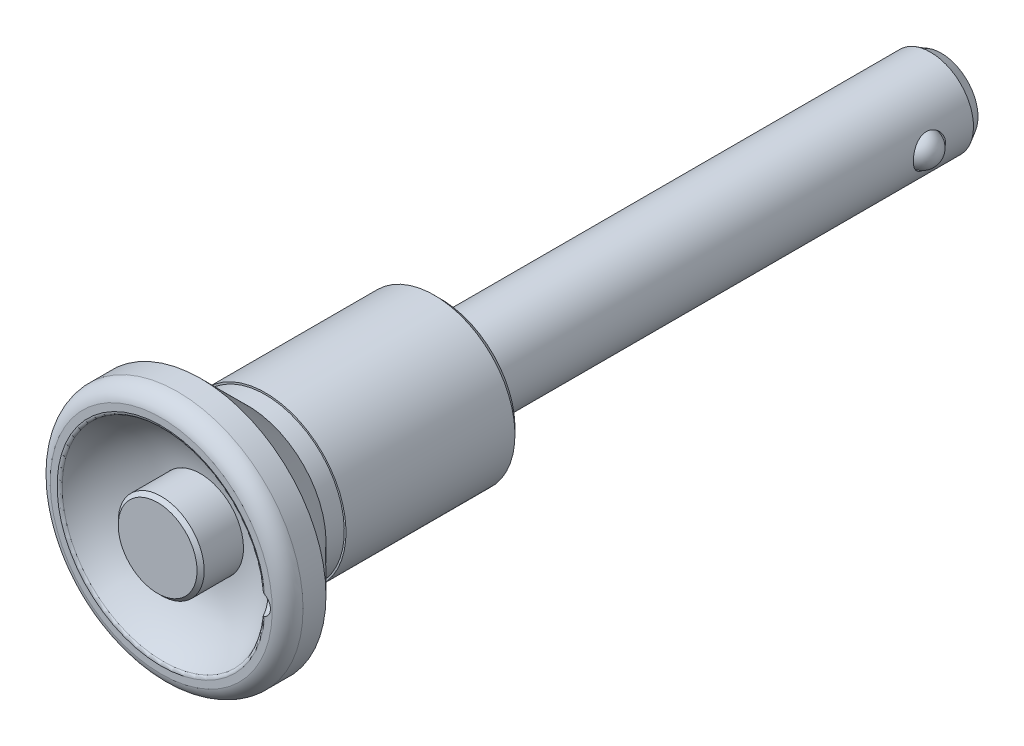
ISO-10303-21;
HEADER;
FILE_DESCRIPTION(('STEP AP214'),'2;1');
FILE_NAME('part.step','',(''),(''),'','','');
FILE_SCHEMA(('AUTOMOTIVE_DESIGN { 1 0 10303 214 1 1 1 1 }'));
ENDSEC;
DATA;
#1=APPLICATION_CONTEXT('core data for automotive mechanical design processes');
#2=APPLICATION_PROTOCOL_DEFINITION('international standard','automotive_design',2000,#1);
#3=PRODUCT_CONTEXT('',#1,'mechanical');
#4=PRODUCT('Part','Part','',(#3));
#5=PRODUCT_RELATED_PRODUCT_CATEGORY('part','',(#4));
#6=PRODUCT_DEFINITION_FORMATION('','',#4);
#7=PRODUCT_DEFINITION_CONTEXT('part definition',#1,'design');
#8=PRODUCT_DEFINITION('design','',#6,#7);
#9=PRODUCT_DEFINITION_SHAPE('','',#8);
#10=(LENGTH_UNIT() NAMED_UNIT(*) SI_UNIT(.MILLI.,.METRE.));
#11=(NAMED_UNIT(*) PLANE_ANGLE_UNIT() SI_UNIT($,.RADIAN.));
#12=(NAMED_UNIT(*) SI_UNIT($,.STERADIAN.) SOLID_ANGLE_UNIT());
#13=UNCERTAINTY_MEASURE_WITH_UNIT(LENGTH_MEASURE(1.E-05),#10,'distance_accuracy_value','');
#14=(GEOMETRIC_REPRESENTATION_CONTEXT(3) GLOBAL_UNCERTAINTY_ASSIGNED_CONTEXT((#13)) GLOBAL_UNIT_ASSIGNED_CONTEXT((#10,
#11,#12)) REPRESENTATION_CONTEXT('',''));
#15=CARTESIAN_POINT('',(0.,0.,0.));
#16=DIRECTION('',(0.,0.,1.));
#17=DIRECTION('',(1.,0.,0.));
#18=AXIS2_PLACEMENT_3D('',#15,#16,#17);
#19=CARTESIAN_POINT('',(0.,0.,-69.9));
#20=DIRECTION('',(0.,0.,-1.));
#21=DIRECTION('',(0.,1.,0.));
#22=AXIS2_PLACEMENT_3D('',#19,#20,#21);
#23=CYLINDRICAL_SURFACE('',#22,6.);
#24=CARTESIAN_POINT('',(-5.56214886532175,2.25,-62.25));
#25=CARTESIAN_POINT('',(-5.5621446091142,2.25000456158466,-62.1284887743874));
#26=CARTESIAN_POINT('',(-5.56617390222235,2.24012396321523,-62.0070076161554));
#27=CARTESIAN_POINT('',(-5.58174238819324,2.20104281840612,-61.7677078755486));
#28=CARTESIAN_POINT('',(-5.59328135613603,2.17184285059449,-61.6498891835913));
#29=CARTESIAN_POINT('',(-5.62238220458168,2.09534486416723,-61.4214369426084));
#30=CARTESIAN_POINT('',(-5.63992964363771,2.04809020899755,-61.3107869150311));
#31=CARTESIAN_POINT('',(-5.67904701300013,1.93697785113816,-61.0989421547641));
#32=CARTESIAN_POINT('',(-5.70061815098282,1.87311516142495,-60.9977502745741));
#33=CARTESIAN_POINT('',(-5.74655362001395,1.72719992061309,-60.802664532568));
#34=CARTESIAN_POINT('',(-5.77100012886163,1.64445571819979,-60.7093072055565));
#35=CARTESIAN_POINT('',(-5.81924625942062,1.46459375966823,-60.5374157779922));
#36=CARTESIAN_POINT('',(-5.84304574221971,1.36747294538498,-60.4588848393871));
#37=CARTESIAN_POINT('',(-5.88829310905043,1.15754198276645,-60.3162907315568));
#38=CARTESIAN_POINT('',(-5.90963341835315,1.04431042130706,-60.2528107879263));
#39=CARTESIAN_POINT('',(-5.94657011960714,0.807833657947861,-60.1460232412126));
#40=CARTESIAN_POINT('',(-5.96216850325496,0.684591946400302,-60.102708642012));
#41=CARTESIAN_POINT('',(-5.98528045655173,0.437234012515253,-60.0393631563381));
#42=CARTESIAN_POINT('',(-5.99311372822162,0.313384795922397,-60.0184085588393));
#43=CARTESIAN_POINT('',(-6.0009602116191,0.0636965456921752,-59.9974181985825));
#44=CARTESIAN_POINT('',(-6.00097596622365,-0.062141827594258,-59.997375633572));
#45=CARTESIAN_POINT('',(-5.9933889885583,-0.305615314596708,-60.0176726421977));
#46=CARTESIAN_POINT('',(-5.9861631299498,-0.423348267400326,-60.0370039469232));
#47=CARTESIAN_POINT('',(-5.96539912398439,-0.653758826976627,-60.0938038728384));
#48=CARTESIAN_POINT('',(-5.95186052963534,-0.76643607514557,-60.1312737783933));
#49=CARTESIAN_POINT('',(-5.91956653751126,-0.985483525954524,-60.2237556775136));
#50=CARTESIAN_POINT('',(-5.90073809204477,-1.09173808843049,-60.2790150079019));
#51=CARTESIAN_POINT('',(-5.85976965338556,-1.29372991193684,-60.4052881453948));
#52=CARTESIAN_POINT('',(-5.83762859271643,-1.3894637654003,-60.4763070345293));
#53=CARTESIAN_POINT('',(-5.79078794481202,-1.57363573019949,-60.6369409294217));
#54=CARTESIAN_POINT('',(-5.76601445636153,-1.66131921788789,-60.727400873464));
#55=CARTESIAN_POINT('',(-5.71773690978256,-1.82055593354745,-60.921889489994));
#56=CARTESIAN_POINT('',(-5.69423317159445,-1.89210511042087,-61.0259215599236));
#57=CARTESIAN_POINT('',(-5.65069055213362,-2.01848417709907,-61.247579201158));
#58=CARTESIAN_POINT('',(-5.63074015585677,-2.07290771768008,-61.3654552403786));
#59=CARTESIAN_POINT('',(-5.59758657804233,-2.16084696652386,-61.6096443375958));
#60=CARTESIAN_POINT('',(-5.58437964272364,-2.19437430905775,-61.7359526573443));
#61=CARTESIAN_POINT('',(-5.56709395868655,-2.23785287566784,-61.9859639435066));
#62=CARTESIAN_POINT('',(-5.56255177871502,-2.24900281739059,-62.109426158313));
#63=CARTESIAN_POINT('',(-5.56179809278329,-2.25086828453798,-62.3565140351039));
#64=CARTESIAN_POINT('',(-5.56558450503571,-2.24158891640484,-62.4801396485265));
#65=CARTESIAN_POINT('',(-5.58059072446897,-2.20394600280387,-62.7178948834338));
#66=CARTESIAN_POINT('',(-5.59144914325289,-2.17650927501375,-62.8321967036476));
#67=CARTESIAN_POINT('',(-5.61894730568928,-2.10449661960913,-63.0545219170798));
#68=CARTESIAN_POINT('',(-5.63558823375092,-2.05991718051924,-63.1625440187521));
#69=CARTESIAN_POINT('',(-5.67354364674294,-1.95300438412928,-63.3737466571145));
#70=CARTESIAN_POINT('',(-5.69500993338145,-1.8900681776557,-63.4765939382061));
#71=CARTESIAN_POINT('',(-5.73994221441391,-1.74886976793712,-63.6706934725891));
#72=CARTESIAN_POINT('',(-5.76340893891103,-1.67060195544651,-63.761941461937));
#73=CARTESIAN_POINT('',(-5.81149569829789,-1.49509101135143,-63.9362525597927));
#74=CARTESIAN_POINT('',(-5.83609454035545,-1.39695951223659,-64.0184301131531));
#75=CARTESIAN_POINT('',(-5.8822481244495,-1.18769620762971,-64.1652575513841));
#76=CARTESIAN_POINT('',(-5.90380285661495,-1.07656435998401,-64.2299073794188));
#77=CARTESIAN_POINT('',(-5.94142478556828,-0.844524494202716,-64.3394190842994));
#78=CARTESIAN_POINT('',(-5.95751072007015,-0.723651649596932,-64.3843486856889));
#79=CARTESIAN_POINT('',(-5.98244155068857,-0.475322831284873,-64.4529846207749));
#80=CARTESIAN_POINT('',(-5.99128984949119,-0.347869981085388,-64.4767009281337));
#81=CARTESIAN_POINT('',(-6.00042610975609,-0.0980033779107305,-64.5011616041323));
#82=CARTESIAN_POINT('',(-6.00118291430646,0.0242711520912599,-64.5031642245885));
#83=CARTESIAN_POINT('',(-5.99527334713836,0.267340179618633,-64.4873772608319));
#84=CARTESIAN_POINT('',(-5.98860787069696,0.388134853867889,-64.4695900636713));
#85=CARTESIAN_POINT('',(-5.96881634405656,0.621822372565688,-64.4156117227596));
#86=CARTESIAN_POINT('',(-5.95585187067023,0.734836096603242,-64.3798801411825));
#87=CARTESIAN_POINT('',(-5.92481675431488,0.953273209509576,-64.2914849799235));
#88=CARTESIAN_POINT('',(-5.90674514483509,1.05869515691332,-64.2388181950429));
#89=CARTESIAN_POINT('',(-5.86635927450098,1.26381026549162,-64.1155290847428));
#90=CARTESIAN_POINT('',(-5.8438986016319,1.36307632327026,-64.0442450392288));
#91=CARTESIAN_POINT('',(-5.79749261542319,1.54862602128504,-63.8867882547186));
#92=CARTESIAN_POINT('',(-5.77354677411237,1.63490500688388,-63.8006102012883));
#93=CARTESIAN_POINT('',(-5.72532194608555,1.7967182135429,-63.6104038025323));
#94=CARTESIAN_POINT('',(-5.70109208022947,1.87144499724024,-63.5056733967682));
#95=CARTESIAN_POINT('',(-5.65647487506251,2.00227064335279,-63.2843761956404));
#96=CARTESIAN_POINT('',(-5.63608793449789,2.05836757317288,-63.1678081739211));
#97=CARTESIAN_POINT('',(-5.60103404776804,2.15198830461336,-62.9205664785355));
#98=CARTESIAN_POINT('',(-5.58665704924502,2.18859004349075,-62.7894984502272));
#99=CARTESIAN_POINT('',(-5.56721991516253,2.23758535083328,-62.5222720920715));
#100=CARTESIAN_POINT('',(-5.56215363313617,2.24999489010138,-62.3861171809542));
#101=CARTESIAN_POINT('',(-5.56214886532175,2.25,-62.25));
#102=B_SPLINE_CURVE_WITH_KNOTS('',3,(#24,#25,#26,#27,#28,#29,#30,#31,#32,#33,#34,#35,#36,#37,
#38,#39,#40,#41,#42,#43,#44,#45,#46,#47,#48,#49,#50,#51,#52,#53,#54,#55,#56,#57,#58,#59,#60,#61,
#62,#63,#64,#65,#66,#67,#68,#69,#70,#71,#72,#73,#74,#75,#76,#77,#78,#79,#80,#81,#82,#83,#84,#85,
#86,#87,#88,#89,#90,#91,#92,#93,#94,#95,#96,#97,#98,#99,#100,#101),.UNSPECIFIED.,.T.,.F.,(4,2,2,
2,2,2,2,2,2,2,2,2,2,2,2,2,2,2,2,2,2,2,2,2,2,2,2,2,2,2,2,2,2,2,2,2,2,2,4),(0.,0.364026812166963,
0.728042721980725,1.091189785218,1.45444601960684,1.83411978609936,2.2138744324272,
2.60655108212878,2.99909139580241,3.37470027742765,3.75018698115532,4.10709709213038,
4.46403247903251,4.82616196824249,5.18840840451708,5.57185012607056,5.95538801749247,
6.34743888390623,6.73927127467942,7.10948486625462,7.47960593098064,7.83215768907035,
8.18478170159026,8.55062341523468,8.91659922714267,9.30577525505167,9.69495254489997,
10.0827826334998,10.4704302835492,10.8354858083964,11.2004973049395,11.5566041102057,
11.9127783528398,12.2839248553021,12.6552040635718,13.0460789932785,13.436994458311,
13.8450476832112,14.2528314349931),.UNSPECIFIED.);
#103=CARTESIAN_POINT('',(-5.56214886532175,2.25,-62.25));
#104=VERTEX_POINT('',#103);
#105=EDGE_CURVE('E68',#104,#104,#102,.T.);
#106=ORIENTED_EDGE('',*,*,#105,.T.);
#107=EDGE_LOOP('',(#106));
#108=FACE_BOUND('',#107,.T.);
#109=CARTESIAN_POINT('',(0.,0.,-68.4));
#110=DIRECTION('',(0.,0.,-1.));
#111=DIRECTION('',(0.,1.,0.));
#112=AXIS2_PLACEMENT_3D('',#109,#110,#111);
#113=CIRCLE('',#112,6.);
#114=CARTESIAN_POINT('',(0.,6.,-68.4));
#115=VERTEX_POINT('',#114);
#116=EDGE_CURVE('E314',#115,#115,#113,.T.);
#117=ORIENTED_EDGE('',*,*,#116,.F.);
#118=EDGE_LOOP('',(#117));
#119=FACE_BOUND('',#118,.T.);
#120=CARTESIAN_POINT('',(5.56214886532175,2.25,-62.25));
#121=CARTESIAN_POINT('',(5.5621446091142,2.25000456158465,-62.3715112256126));
#122=CARTESIAN_POINT('',(5.56617390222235,2.24012396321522,-62.4929923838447));
#123=CARTESIAN_POINT('',(5.58174238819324,2.20104281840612,-62.7322921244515));
#124=CARTESIAN_POINT('',(5.59328135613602,2.1718428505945,-62.8501108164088));
#125=CARTESIAN_POINT('',(5.62238220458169,2.09534486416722,-63.0785630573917));
#126=CARTESIAN_POINT('',(5.63992964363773,2.04809020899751,-63.189213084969));
#127=CARTESIAN_POINT('',(5.67904701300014,1.93697785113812,-63.401057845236));
#128=CARTESIAN_POINT('',(5.70061815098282,1.87311516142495,-63.502249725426));
#129=CARTESIAN_POINT('',(5.74655362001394,1.72719992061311,-63.6973354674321));
#130=CARTESIAN_POINT('',(5.77100012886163,1.64445571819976,-63.7906927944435));
#131=CARTESIAN_POINT('',(5.81924625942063,1.46459375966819,-63.9625842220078));
#132=CARTESIAN_POINT('',(5.84304574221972,1.36747294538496,-64.0411151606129));
#133=CARTESIAN_POINT('',(5.88829310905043,1.15754198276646,-64.1837092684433));
#134=CARTESIAN_POINT('',(5.90963341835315,1.04431042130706,-64.2471892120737));
#135=CARTESIAN_POINT('',(5.94657011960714,0.807833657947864,-64.3539767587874));
#136=CARTESIAN_POINT('',(5.96216850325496,0.684591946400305,-64.397291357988));
#137=CARTESIAN_POINT('',(5.98528045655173,0.437234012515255,-64.4606368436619));
#138=CARTESIAN_POINT('',(5.99311372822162,0.313384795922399,-64.4815914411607));
#139=CARTESIAN_POINT('',(6.0009602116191,0.0636965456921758,-64.5025818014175));
#140=CARTESIAN_POINT('',(6.00097596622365,-0.0621418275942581,-64.502624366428));
#141=CARTESIAN_POINT('',(5.9933889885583,-0.305615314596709,-64.4823273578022));
#142=CARTESIAN_POINT('',(5.9861631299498,-0.423348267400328,-64.4629960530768));
#143=CARTESIAN_POINT('',(5.96539912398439,-0.653758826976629,-64.4061961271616));
#144=CARTESIAN_POINT('',(5.95186052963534,-0.766436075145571,-64.3687262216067));
#145=CARTESIAN_POINT('',(5.91956653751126,-0.985483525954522,-64.2762443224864));
#146=CARTESIAN_POINT('',(5.90073809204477,-1.09173808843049,-64.2209849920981));
#147=CARTESIAN_POINT('',(5.85976965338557,-1.29372991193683,-64.0947118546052));
#148=CARTESIAN_POINT('',(5.83762859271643,-1.38946376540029,-64.0236929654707));
#149=CARTESIAN_POINT('',(5.79078794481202,-1.57363573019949,-63.8630590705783));
#150=CARTESIAN_POINT('',(5.76601445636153,-1.66131921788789,-63.772599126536));
#151=CARTESIAN_POINT('',(5.71773690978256,-1.82055593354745,-63.578110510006));
#152=CARTESIAN_POINT('',(5.69423317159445,-1.89210511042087,-63.4740784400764));
#153=CARTESIAN_POINT('',(5.65069055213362,-2.01848417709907,-63.252420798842));
#154=CARTESIAN_POINT('',(5.63074015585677,-2.07290771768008,-63.1345447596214));
#155=CARTESIAN_POINT('',(5.59758657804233,-2.16084696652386,-62.8903556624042));
#156=CARTESIAN_POINT('',(5.58437964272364,-2.19437430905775,-62.7640473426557));
#157=CARTESIAN_POINT('',(5.56709395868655,-2.23785287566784,-62.5140360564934));
#158=CARTESIAN_POINT('',(5.56255177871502,-2.24900281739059,-62.3905738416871));
#159=CARTESIAN_POINT('',(5.56179809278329,-2.25086828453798,-62.1434859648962));
#160=CARTESIAN_POINT('',(5.56558450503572,-2.24158891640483,-62.0198603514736));
#161=CARTESIAN_POINT('',(5.58059072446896,-2.20394600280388,-61.7821051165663));
#162=CARTESIAN_POINT('',(5.59144914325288,-2.17650927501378,-61.6678032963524));
#163=CARTESIAN_POINT('',(5.61894730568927,-2.10449661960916,-61.4454780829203));
#164=CARTESIAN_POINT('',(5.63558823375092,-2.05991718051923,-61.337455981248));
#165=CARTESIAN_POINT('',(5.67354364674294,-1.95300438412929,-61.1262533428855));
#166=CARTESIAN_POINT('',(5.69500993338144,-1.89006817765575,-61.023406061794));
#167=CARTESIAN_POINT('',(5.73994221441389,-1.74886976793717,-60.829306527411));
#168=CARTESIAN_POINT('',(5.76340893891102,-1.67060195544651,-60.7380585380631));
#169=CARTESIAN_POINT('',(5.8114956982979,-1.49509101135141,-60.5637474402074));
#170=CARTESIAN_POINT('',(5.83609454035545,-1.3969595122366,-60.4815698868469));
#171=CARTESIAN_POINT('',(5.88224812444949,-1.18769620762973,-60.3347424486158));
#172=CARTESIAN_POINT('',(5.90380285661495,-1.07656435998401,-60.2700926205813));
#173=CARTESIAN_POINT('',(5.94142478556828,-0.844524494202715,-60.1605809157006));
#174=CARTESIAN_POINT('',(5.95751072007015,-0.723651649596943,-60.1156513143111));
#175=CARTESIAN_POINT('',(5.98244155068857,-0.475322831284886,-60.0470153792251));
#176=CARTESIAN_POINT('',(5.99128984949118,-0.347869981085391,-60.0232990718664));
#177=CARTESIAN_POINT('',(6.0004261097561,-0.0980033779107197,-59.9988383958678));
#178=CARTESIAN_POINT('',(6.00118291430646,0.0242711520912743,-59.9968357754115));
#179=CARTESIAN_POINT('',(5.99527334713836,0.267340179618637,-60.0126227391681));
#180=CARTESIAN_POINT('',(5.98860787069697,0.38813485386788,-60.0304099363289));
#181=CARTESIAN_POINT('',(5.96881634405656,0.621822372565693,-60.0843882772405));
#182=CARTESIAN_POINT('',(5.95585187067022,0.734836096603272,-60.1201198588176));
#183=CARTESIAN_POINT('',(5.92481675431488,0.953273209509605,-60.2085150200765));
#184=CARTESIAN_POINT('',(5.90674514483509,1.05869515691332,-60.2611818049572));
#185=CARTESIAN_POINT('',(5.86635927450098,1.26381026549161,-60.3844709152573));
#186=CARTESIAN_POINT('',(5.8438986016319,1.36307632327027,-60.4557549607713));
#187=CARTESIAN_POINT('',(5.79749261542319,1.54862602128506,-60.6132117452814));
#188=CARTESIAN_POINT('',(5.77354677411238,1.63490500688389,-60.6993897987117));
#189=CARTESIAN_POINT('',(5.72532194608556,1.7967182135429,-60.8895961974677));
#190=CARTESIAN_POINT('',(5.70109208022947,1.87144499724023,-60.9943266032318));
#191=CARTESIAN_POINT('',(5.6564748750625,2.00227064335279,-61.2156238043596));
#192=CARTESIAN_POINT('',(5.63608793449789,2.05836757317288,-61.3321918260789));
#193=CARTESIAN_POINT('',(5.60103404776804,2.15198830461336,-61.5794335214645));
#194=CARTESIAN_POINT('',(5.58665704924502,2.18859004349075,-61.7105015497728));
#195=CARTESIAN_POINT('',(5.56721991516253,2.23758535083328,-61.9777279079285));
#196=CARTESIAN_POINT('',(5.56215363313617,2.24999489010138,-62.1138828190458));
#197=CARTESIAN_POINT('',(5.56214886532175,2.25,-62.25));
#198=B_SPLINE_CURVE_WITH_KNOTS('',3,(#120,#121,#122,#123,#124,#125,#126,#127,#128,#129,#130,
#131,#132,#133,#134,#135,#136,#137,#138,#139,#140,#141,#142,#143,#144,#145,#146,#147,#148,#149,
#150,#151,#152,#153,#154,#155,#156,#157,#158,#159,#160,#161,#162,#163,#164,#165,#166,#167,#168,
#169,#170,#171,#172,#173,#174,#175,#176,#177,#178,#179,#180,#181,#182,#183,#184,#185,#186,#187,
#188,#189,#190,#191,#192,#193,#194,#195,#196,#197),.UNSPECIFIED.,.T.,.F.,(4,2,2,2,2,2,2,2,2,2,2,
2,2,2,2,2,2,2,2,2,2,2,2,2,2,2,2,2,2,2,2,2,2,2,2,2,2,2,4),(0.,0.364026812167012,
0.728042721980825,1.09118978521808,1.45444601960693,1.83411978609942,2.21387443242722,
2.60655108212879,2.99909139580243,3.37470027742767,3.75018698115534,4.1070970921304,
4.46403247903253,4.8261619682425,5.1884084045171,5.57185012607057,5.95538801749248,
6.34743888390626,6.73927127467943,7.10948486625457,7.47960593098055,7.83215768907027,
8.18478170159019,8.5506234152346,8.91659922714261,9.30577525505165,9.69495254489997,
10.0827826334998,10.4704302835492,10.8354858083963,11.2004973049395,11.5566041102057,
11.9127783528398,12.2839248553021,12.6552040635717,13.0460789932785,13.4369944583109,
13.8450476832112,14.2528314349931),.UNSPECIFIED.);
#199=CARTESIAN_POINT('',(5.56214886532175,2.25,-62.25));
#200=VERTEX_POINT('',#199);
#201=EDGE_CURVE('E292',#200,#200,#198,.T.);
#202=ORIENTED_EDGE('',*,*,#201,.T.);
#203=EDGE_LOOP('',(#202));
#204=FACE_BOUND('',#203,.T.);
#205=CARTESIAN_POINT('',(0.,0.,0.));
#206=DIRECTION('',(0.,0.,1.));
#207=DIRECTION('',(1.,0.,0.));
#208=AXIS2_PLACEMENT_3D('',#205,#206,#207);
#209=CIRCLE('',#208,6.);
#210=CARTESIAN_POINT('',(6.,0.,0.));
#211=VERTEX_POINT('',#210);
#212=EDGE_CURVE('E80',#211,#211,#209,.T.);
#213=ORIENTED_EDGE('',*,*,#212,.F.);
#214=EDGE_LOOP('',(#213));
#215=FACE_BOUND('',#214,.T.);
#216=ADVANCED_FACE('F14',(#108,#119,#204,#215),#23,.T.);
#217=CARTESIAN_POINT('',(0.,0.,-69.9));
#218=DIRECTION('',(0.,0.,-1.));
#219=DIRECTION('',(0.,1.,0.));
#220=AXIS2_PLACEMENT_3D('',#217,#218,#219);
#221=CYLINDRICAL_SURFACE('',#220,2.75);
#222=CARTESIAN_POINT('',(0.,0.,-64.5));
#223=DIRECTION('',(0.,0.,-1.));
#224=DIRECTION('',(0.,1.,0.));
#225=AXIS2_PLACEMENT_3D('',#222,#223,#224);
#226=CIRCLE('',#225,2.75);
#227=CARTESIAN_POINT('',(0.,2.75,-64.5));
#228=VERTEX_POINT('',#227);
#229=EDGE_CURVE('E74',#228,#228,#226,.T.);
#230=ORIENTED_EDGE('',*,*,#229,.F.);
#231=EDGE_LOOP('',(#230));
#232=FACE_BOUND('',#231,.T.);
#233=CARTESIAN_POINT('',(0.,0.,-69.9));
#234=DIRECTION('',(0.,0.,-1.));
#235=DIRECTION('',(0.,1.,0.));
#236=AXIS2_PLACEMENT_3D('',#233,#234,#235);
#237=CIRCLE('',#236,2.75);
#238=CARTESIAN_POINT('',(0.,2.75,-69.9));
#239=VERTEX_POINT('',#238);
#240=EDGE_CURVE('E306',#239,#239,#237,.T.);
#241=ORIENTED_EDGE('',*,*,#240,.T.);
#242=EDGE_LOOP('',(#241));
#243=FACE_BOUND('',#242,.T.);
#244=ADVANCED_FACE('F273',(#232,#243),#221,.F.);
#245=CARTESIAN_POINT('',(2.75,0.,-69.9));
#246=DIRECTION('',(0.,0.,-1.));
#247=DIRECTION('',(0.,1.,0.));
#248=AXIS2_PLACEMENT_3D('',#245,#246,#247);
#249=PLANE('',#248);
#250=CARTESIAN_POINT('',(0.,0.,-69.9));
#251=DIRECTION('',(0.,0.,-1.));
#252=DIRECTION('',(0.,1.,0.));
#253=AXIS2_PLACEMENT_3D('',#250,#251,#252);
#254=CIRCLE('',#253,5.13397459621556);
#255=CARTESIAN_POINT('',(0.,5.13397459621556,-69.9));
#256=VERTEX_POINT('',#255);
#257=EDGE_CURVE('E310',#256,#256,#254,.T.);
#258=ORIENTED_EDGE('',*,*,#257,.T.);
#259=EDGE_LOOP('',(#258));
#260=FACE_BOUND('',#259,.T.);
#261=ORIENTED_EDGE('',*,*,#240,.F.);
#262=EDGE_LOOP('',(#261));
#263=FACE_BOUND('',#262,.T.);
#264=ADVANCED_FACE('F280',(#260,#263),#249,.T.);
#265=CARTESIAN_POINT('',(0.,0.,-69.9));
#266=DIRECTION('',(0.,0.,1.));
#267=DIRECTION('',(0.,-1.,0.));
#268=AXIS2_PLACEMENT_3D('',#265,#266,#267);
#269=CONICAL_SURFACE('',#268,5.13397459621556,0.523598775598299);
#270=ORIENTED_EDGE('',*,*,#116,.T.);
#271=EDGE_LOOP('',(#270));
#272=FACE_BOUND('',#271,.T.);
#273=ORIENTED_EDGE('',*,*,#257,.F.);
#274=EDGE_LOOP('',(#273));
#275=FACE_BOUND('',#274,.T.);
#276=ADVANCED_FACE('F288',(#272,#275),#269,.T.);
#277=CARTESIAN_POINT('',(7.,0.,-62.25));
#278=DIRECTION('',(1.,0.,0.));
#279=DIRECTION('',(0.,1.,0.));
#280=AXIS2_PLACEMENT_3D('',#277,#278,#279);
#281=CYLINDRICAL_SURFACE('',#280,2.25);
#282=CARTESIAN_POINT('',(4.70120856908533,2.25,-62.25));
#283=CARTESIAN_POINT('',(4.70121469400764,2.24999417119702,-62.1304590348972));
#284=CARTESIAN_POINT('',(4.70583400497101,2.2404126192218,-62.0107125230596));
#285=CARTESIAN_POINT('',(4.72369711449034,2.20249080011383,-61.774718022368));
#286=CARTESIAN_POINT('',(4.73696351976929,2.17410135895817,-61.6584800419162));
#287=CARTESIAN_POINT('',(4.77031963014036,2.09989154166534,-61.4333349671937));
#288=CARTESIAN_POINT('',(4.79038009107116,2.05414577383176,-61.324398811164));
#289=CARTESIAN_POINT('',(4.83501981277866,1.94674472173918,-61.1157771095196));
#290=CARTESIAN_POINT('',(4.85959823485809,1.88509238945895,-61.016089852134));
#291=CARTESIAN_POINT('',(4.91234222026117,1.74321937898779,-60.8220680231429));
#292=CARTESIAN_POINT('',(4.94063496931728,1.66209866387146,-60.7284258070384));
#293=CARTESIAN_POINT('',(4.99657815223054,1.485478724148,-60.5555585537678));
#294=CARTESIAN_POINT('',(5.02422832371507,1.38997374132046,-60.4763393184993));
#295=CARTESIAN_POINT('',(5.07733633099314,1.18176930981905,-60.3309420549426));
#296=CARTESIAN_POINT('',(5.10262925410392,1.06847133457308,-60.2655553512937));
#297=CARTESIAN_POINT('',(5.14660113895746,0.831192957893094,-60.1550726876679));
#298=CARTESIAN_POINT('',(5.16528324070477,0.707217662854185,-60.1099670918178));
#299=CARTESIAN_POINT('',(5.1930243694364,0.459385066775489,-60.0438746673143));
#300=CARTESIAN_POINT('',(5.20255899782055,0.33590140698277,-60.0216905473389));
#301=CARTESIAN_POINT('',(5.21266651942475,0.0866213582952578,-59.9981895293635));
#302=CARTESIAN_POINT('',(5.21324333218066,-0.0391739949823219,-59.9968635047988));
#303=CARTESIAN_POINT('',(5.20564133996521,-0.280752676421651,-60.0145162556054));
#304=CARTESIAN_POINT('',(5.19803132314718,-0.396653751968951,-60.0321759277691));
#305=CARTESIAN_POINT('',(5.17570524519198,-0.623658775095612,-60.0850210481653));
#306=CARTESIAN_POINT('',(5.16098865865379,-0.734762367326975,-60.1202077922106));
#307=CARTESIAN_POINT('',(5.12557562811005,-0.951074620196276,-60.2075078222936));
#308=CARTESIAN_POINT('',(5.10479112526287,-1.05616705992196,-60.2598718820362));
#309=CARTESIAN_POINT('',(5.05924909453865,-1.25634985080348,-60.3797828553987));
#310=CARTESIAN_POINT('',(5.03449013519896,-1.35143657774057,-60.4473352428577));
#311=CARTESIAN_POINT('',(4.9812692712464,-1.53647964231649,-60.6015757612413));
#312=CARTESIAN_POINT('',(4.95266891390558,-1.62551877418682,-60.689317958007));
#313=CARTESIAN_POINT('',(4.89634671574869,-1.78803350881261,-60.8785052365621));
#314=CARTESIAN_POINT('',(4.8686252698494,-1.86150219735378,-60.9799563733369));
#315=CARTESIAN_POINT('',(4.81616806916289,-1.99339518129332,-61.1984520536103));
#316=CARTESIAN_POINT('',(4.79158303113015,-2.05115292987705,-61.3159383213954));
#317=CARTESIAN_POINT('',(4.75001097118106,-2.1456830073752,-61.5603104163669));
#318=CARTESIAN_POINT('',(4.73301805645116,-2.18247161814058,-61.6871888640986));
#319=CARTESIAN_POINT('',(4.7100473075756,-2.2315930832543,-61.9375319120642));
#320=CARTESIAN_POINT('',(4.70339790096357,-2.24542132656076,-62.0606401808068));
#321=CARTESIAN_POINT('',(4.69994279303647,-2.25264846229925,-62.3075714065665));
#322=CARTESIAN_POINT('',(4.70313324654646,-2.24605533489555,-62.431394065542));
#323=CARTESIAN_POINT('',(4.71830050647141,-2.21399394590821,-62.6669653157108));
#324=CARTESIAN_POINT('',(4.72963794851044,-2.18989787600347,-62.778947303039));
#325=CARTESIAN_POINT('',(4.75898261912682,-2.12536894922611,-62.9971687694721));
#326=CARTESIAN_POINT('',(4.77699148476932,-2.08493208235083,-63.1034068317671));
#327=CARTESIAN_POINT('',(4.81860535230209,-1.98691927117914,-63.3123309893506));
#328=CARTESIAN_POINT('',(4.84242072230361,-1.92867086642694,-63.414658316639));
#329=CARTESIAN_POINT('',(4.89268495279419,-1.79734114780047,-63.6086003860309));
#330=CARTESIAN_POINT('',(4.91913500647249,-1.72425309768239,-63.7002102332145));
#331=CARTESIAN_POINT('',(4.97451487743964,-1.5576964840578,-63.8785741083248));
#332=CARTESIAN_POINT('',(5.00345675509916,-1.46299589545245,-63.9641786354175));
#333=CARTESIAN_POINT('',(5.05840859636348,-1.25992784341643,-64.11851397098));
#334=CARTESIAN_POINT('',(5.0844182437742,-1.15155890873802,-64.1872429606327));
#335=CARTESIAN_POINT('',(5.13083610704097,-0.923055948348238,-64.3059980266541));
#336=CARTESIAN_POINT('',(5.15121223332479,-0.80285960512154,-64.3559175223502));
#337=CARTESIAN_POINT('',(5.18380508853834,-0.554662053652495,-64.4344361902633));
#338=CARTESIAN_POINT('',(5.19602706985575,-0.426665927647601,-64.4630490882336));
#339=CARTESIAN_POINT('',(5.21029045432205,-0.176736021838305,-64.4963229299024));
#340=CARTESIAN_POINT('',(5.21301888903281,-0.0550554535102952,-64.5026010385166));
#341=CARTESIAN_POINT('',(5.20993078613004,0.187600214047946,-64.495446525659));
#342=CARTESIAN_POINT('',(5.2041159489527,0.308575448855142,-64.4820178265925));
#343=CARTESIAN_POINT('',(5.18496872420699,0.541359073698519,-64.436990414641));
#344=CARTESIAN_POINT('',(5.17194743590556,0.653340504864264,-64.4061426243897));
#345=CARTESIAN_POINT('',(5.13986314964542,0.870473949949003,-64.3280030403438));
#346=CARTESIAN_POINT('',(5.12079904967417,0.975624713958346,-64.2807082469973));
#347=CARTESIAN_POINT('',(5.07736891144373,1.18141977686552,-64.1686191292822));
#348=CARTESIAN_POINT('',(5.05280038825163,1.2816385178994,-64.1031238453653));
#349=CARTESIAN_POINT('',(5.00122306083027,1.47009921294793,-63.957485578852));
#350=CARTESIAN_POINT('',(4.9742132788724,1.5583363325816,-63.877336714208));
#351=CARTESIAN_POINT('',(4.9182708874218,1.72712341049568,-63.6976966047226));
#352=CARTESIAN_POINT('',(4.88934356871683,1.80662459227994,-63.5972140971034));
#353=CARTESIAN_POINT('',(4.83482876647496,1.94782882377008,-63.3835276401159));
#354=CARTESIAN_POINT('',(4.80924325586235,2.00952138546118,-63.270316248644));
#355=CARTESIAN_POINT('',(4.76470338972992,2.11297708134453,-63.0338474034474));
#356=CARTESIAN_POINT('',(4.74574393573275,2.15475554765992,-62.9105977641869));
#357=CARTESIAN_POINT('',(4.72435108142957,2.20105394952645,-62.7212685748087));
#358=CARTESIAN_POINT('',(4.71839681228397,2.21375426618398,-62.6574783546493));
#359=CARTESIAN_POINT('',(4.70903769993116,2.23359624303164,-62.5288695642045));
#360=CARTESIAN_POINT('',(4.70563091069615,2.24074214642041,-62.4640518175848));
#361=CARTESIAN_POINT('',(4.7027842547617,2.24670526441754,-62.3742341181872));
#362=CARTESIAN_POINT('',(4.70219412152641,2.24794009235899,-62.349407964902));
#363=CARTESIAN_POINT('',(4.70140563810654,2.24958807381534,-62.2997241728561));
#364=CARTESIAN_POINT('',(4.70120729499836,2.25000121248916,-62.2748665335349));
#365=CARTESIAN_POINT('',(4.70120856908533,2.25,-62.25));
#366=B_SPLINE_CURVE_WITH_KNOTS('',3,(#282,#283,#284,#285,#286,#287,#288,#289,#290,#291,#292,
#293,#294,#295,#296,#297,#298,#299,#300,#301,#302,#303,#304,#305,#306,#307,#308,#309,#310,#311,
#312,#313,#314,#315,#316,#317,#318,#319,#320,#321,#322,#323,#324,#325,#326,#327,#328,#329,#330,
#331,#332,#333,#334,#335,#336,#337,#338,#339,#340,#341,#342,#343,#344,#345,#346,#347,#348,#349,
#350,#351,#352,#353,#354,#355,#356,#357,#358,#359,#360,#361,#362,#363,#364,#365),.UNSPECIFIED.,
.T.,.F.,(4,2,2,2,2,2,2,2,2,2,2,2,2,2,2,2,2,2,2,2,2,2,2,2,2,2,2,2,2,2,2,2,2,2,2,2,2,2,2,2,2,4),
(0.,0.358523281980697,0.717987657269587,1.07592402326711,1.43379401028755,1.81338979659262,
2.19313794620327,2.5907971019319,2.98826712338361,3.36372670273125,3.73902199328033,
4.08983186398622,4.44066767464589,4.79687203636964,5.15320497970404,5.53621810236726,
5.91940095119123,6.31693575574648,6.71416146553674,7.08432459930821,7.4543431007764,
7.7981123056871,8.14196592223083,8.50086375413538,8.85992486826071,9.2508012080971,
9.64171965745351,10.0348210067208,10.427668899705,10.7914180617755,11.1550948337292,
11.5041747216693,11.8533183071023,12.2184179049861,12.583664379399,12.9758816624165,
13.3683294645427,13.7604746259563,13.9561801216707,14.1517359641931,14.2263134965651,
14.3008923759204),.UNSPECIFIED.);
#367=CARTESIAN_POINT('',(4.84677342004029,1.91641577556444,-63.4289192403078));
#368=VERTEX_POINT('',#367);
#369=CARTESIAN_POINT('',(4.84677342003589,-1.91641577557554,-63.4289192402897));
#370=VERTEX_POINT('',#369);
#371=EDGE_CURVE('E70',#368,#370,#366,.T.);
#372=ORIENTED_EDGE('',*,*,#371,.F.);
#373=CARTESIAN_POINT('',(5.21189620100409,0.,-64.5));
#374=CARTESIAN_POINT('',(5.2118961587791,0.126284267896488,-64.4999948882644));
#375=CARTESIAN_POINT('',(5.21139467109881,0.252644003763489,-64.4893340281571));
#376=CARTESIAN_POINT('',(5.20938058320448,0.501864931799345,-64.4469613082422));
#377=CARTESIAN_POINT('',(5.20786696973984,0.624722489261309,-64.4152283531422));
#378=CARTESIAN_POINT('',(5.20380519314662,0.863320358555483,-64.3316208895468));
#379=CARTESIAN_POINT('',(5.20125743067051,0.979063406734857,-64.2797541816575));
#380=CARTESIAN_POINT('',(5.19508229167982,1.20015943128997,-64.1573752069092));
#381=CARTESIAN_POINT('',(5.19145518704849,1.30551501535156,-64.0868676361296));
#382=CARTESIAN_POINT('',(5.18303472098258,1.50291352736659,-63.9291996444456));
#383=CARTESIAN_POINT('',(5.17824107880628,1.59495324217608,-63.8420352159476));
#384=CARTESIAN_POINT('',(5.16733442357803,1.76311423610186,-63.653525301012));
#385=CARTESIAN_POINT('',(5.1612210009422,1.83923055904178,-63.5521754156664));
#386=CARTESIAN_POINT('',(5.14734400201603,1.97343552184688,-63.3381336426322));
#387=CARTESIAN_POINT('',(5.13957863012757,2.03150437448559,-63.2254294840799));
#388=CARTESIAN_POINT('',(5.12176723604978,2.12782849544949,-62.9921124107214));
#389=CARTESIAN_POINT('',(5.111724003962,2.1661078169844,-62.8715092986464));
#390=CARTESIAN_POINT('',(5.0933054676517,2.20774061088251,-62.6884429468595));
#391=CARTESIAN_POINT('',(5.08666779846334,2.21896106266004,-62.6275162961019));
#392=CARTESIAN_POINT('',(5.07117135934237,2.23631965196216,-62.5053136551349));
#393=CARTESIAN_POINT('',(5.06231462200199,2.24246241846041,-62.444038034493));
#394=CARTESIAN_POINT('',(5.0447395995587,2.24786649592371,-62.3524947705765));
#395=CARTESIAN_POINT('',(5.03817832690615,2.24903385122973,-62.3220839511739));
#396=CARTESIAN_POINT('',(5.02487846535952,2.24972982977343,-62.2856268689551));
#397=CARTESIAN_POINT('',(5.02196282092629,2.24983087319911,-62.278411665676));
#398=CARTESIAN_POINT('',(5.01679668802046,2.24992122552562,-62.2690075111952));
#399=CARTESIAN_POINT('',(5.01524668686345,2.24994100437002,-62.2664653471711));
#400=CARTESIAN_POINT('',(5.01258312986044,2.24996347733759,-62.2628773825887));
#401=CARTESIAN_POINT('',(5.01163231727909,2.24996978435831,-62.2617128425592));
#402=CARTESIAN_POINT('',(5.00957474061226,2.24998007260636,-62.2595306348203));
#403=CARTESIAN_POINT('',(5.00846878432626,2.24998406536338,-62.258512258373));
#404=CARTESIAN_POINT('',(5.0067156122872,2.2499883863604,-62.2572404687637));
#405=CARTESIAN_POINT('',(5.00615104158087,2.2499895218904,-62.2568745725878));
#406=CARTESIAN_POINT('',(5.00497729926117,2.2499914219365,-62.2562214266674));
#407=CARTESIAN_POINT('',(5.00436814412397,2.24999218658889,-62.255934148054));
#408=CARTESIAN_POINT('',(5.00310140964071,2.24999338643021,-62.2554607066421));
#409=CARTESIAN_POINT('',(5.00244330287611,2.24999381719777,-62.2552759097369));
#410=CARTESIAN_POINT('',(5.0011038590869,2.24999436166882,-62.2550386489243));
#411=CARTESIAN_POINT('',(5.00042256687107,2.24999447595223,-62.2549859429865));
#412=CARTESIAN_POINT('',(4.99914424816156,2.24999440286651,-62.2550185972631));
#413=CARTESIAN_POINT('',(4.99854676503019,2.24999424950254,-62.2550883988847));
#414=CARTESIAN_POINT('',(4.99737209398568,2.24999369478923,-62.2553279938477));
#415=CARTESIAN_POINT('',(4.99679493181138,2.24999329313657,-62.2554979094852));
#416=CARTESIAN_POINT('',(4.99546550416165,2.24999202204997,-62.255998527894));
#417=CARTESIAN_POINT('',(4.99472705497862,2.24999103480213,-62.2563654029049));
#418=CARTESIAN_POINT('',(4.99331619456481,2.24998849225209,-62.2572086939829));
#419=CARTESIAN_POINT('',(4.99264394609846,2.24998693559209,-62.257685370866));
#420=CARTESIAN_POINT('',(4.99079786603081,2.24998155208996,-62.2591607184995));
#421=CARTESIAN_POINT('',(4.98969889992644,2.24997693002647,-62.2602516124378));
#422=CARTESIAN_POINT('',(4.98765562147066,2.24996520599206,-62.2625688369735));
#423=CARTESIAN_POINT('',(4.98671188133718,2.249958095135,-62.2637956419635));
#424=CARTESIAN_POINT('',(4.98193653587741,2.2499128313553,-62.2705312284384));
#425=CARTESIAN_POINT('',(4.97899990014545,2.2498503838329,-62.2766418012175));
#426=CARTESIAN_POINT('',(4.97376920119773,2.24966896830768,-62.2891278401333));
#427=CARTESIAN_POINT('',(4.97148201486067,2.24954942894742,-62.2955053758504));
#428=CARTESIAN_POINT('',(4.96106149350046,2.24881762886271,-62.3271058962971));
#429=CARTESIAN_POINT('',(4.95530816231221,2.24778447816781,-62.3531043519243));
#430=CARTESIAN_POINT('',(4.9450118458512,2.24479018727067,-62.4053004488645));
#431=CARTESIAN_POINT('',(4.9404752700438,2.24282427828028,-62.4314984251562));
#432=CARTESIAN_POINT('',(4.92798476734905,2.23550007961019,-62.5104298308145));
#433=CARTESIAN_POINT('',(4.92120435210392,2.22872063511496,-62.5632520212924));
#434=CARTESIAN_POINT('',(4.9089113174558,2.21142389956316,-62.6682645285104));
#435=CARTESIAN_POINT('',(4.90339617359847,2.20091415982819,-62.7204559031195));
#436=CARTESIAN_POINT('',(4.88803764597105,2.16373012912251,-62.8762327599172));
#437=CARTESIAN_POINT('',(4.87942579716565,2.13143364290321,-62.9786677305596));
#438=CARTESIAN_POINT('',(4.86395279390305,2.05263870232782,-63.1776953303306));
#439=CARTESIAN_POINT('',(4.85708717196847,2.00617717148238,-63.2743023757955));
#440=CARTESIAN_POINT('',(4.84463430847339,1.8999869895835,-63.4599495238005));
#441=CARTESIAN_POINT('',(4.83904642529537,1.84026502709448,-63.5489934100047));
#442=CARTESIAN_POINT('',(4.82796886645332,1.69683921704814,-63.7329593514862));
#443=CARTESIAN_POINT('',(4.82267830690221,1.61075316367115,-63.8260495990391));
#444=CARTESIAN_POINT('',(4.81331124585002,1.42411005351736,-63.9965405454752));
#445=CARTESIAN_POINT('',(4.80923548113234,1.32354426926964,-64.0739317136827));
#446=CARTESIAN_POINT('',(4.80219403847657,1.11084101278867,-64.2107437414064));
#447=CARTESIAN_POINT('',(4.79922814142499,0.998705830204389,-64.270168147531));
#448=CARTESIAN_POINT('',(4.79434733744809,0.766047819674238,-64.3693541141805));
#449=CARTESIAN_POINT('',(4.7924323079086,0.645525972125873,-64.4091179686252));
#450=CARTESIAN_POINT('',(4.78962227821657,0.399571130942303,-64.4678412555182));
#451=CARTESIAN_POINT('',(4.78872674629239,0.274140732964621,-64.4868115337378));
#452=CARTESIAN_POINT('',(4.78794106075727,0.0218703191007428,-64.5034420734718));
#453=CARTESIAN_POINT('',(4.78805091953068,-0.104969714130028,-64.5011020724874));
#454=CARTESIAN_POINT('',(4.78927737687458,-0.356418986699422,-64.4751821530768));
#455=CARTESIAN_POINT('',(4.79039368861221,-0.481028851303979,-64.4516082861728));
#456=CARTESIAN_POINT('',(4.79364906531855,-0.724519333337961,-64.3839024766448));
#457=CARTESIAN_POINT('',(4.79578813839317,-0.843399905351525,-64.339770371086));
#458=CARTESIAN_POINT('',(4.80112512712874,-1.0720730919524,-64.2322025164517));
#459=CARTESIAN_POINT('',(4.80432317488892,-1.18186457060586,-64.1687643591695));
#460=CARTESIAN_POINT('',(4.81184515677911,-1.3892259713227,-64.0244041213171));
#461=CARTESIAN_POINT('',(4.81616903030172,-1.48679655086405,-63.9434829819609));
#462=CARTESIAN_POINT('',(4.82606445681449,-1.66699500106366,-63.7664389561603));
#463=CARTESIAN_POINT('',(4.8316364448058,-1.74961764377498,-63.6703107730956));
#464=CARTESIAN_POINT('',(4.84427017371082,-1.89756793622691,-63.465602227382));
#465=CARTESIAN_POINT('',(4.85133233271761,-1.96289072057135,-63.3570183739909));
#466=CARTESIAN_POINT('',(4.86742332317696,-2.07443577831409,-63.1304409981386));
#467=CARTESIAN_POINT('',(4.87645418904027,-2.12063814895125,-63.0124378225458));
#468=CARTESIAN_POINT('',(4.89787609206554,-2.19253624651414,-62.7707327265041));
#469=CARTESIAN_POINT('',(4.91026387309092,-2.2182517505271,-62.6470364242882));
#470=CARTESIAN_POINT('',(4.93489152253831,-2.24079197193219,-62.4621887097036));
#471=CARTESIAN_POINT('',(4.94392093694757,-2.24567525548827,-62.4016395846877));
#472=CARTESIAN_POINT('',(4.96144377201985,-2.24865520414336,-62.3288938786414));
#473=CARTESIAN_POINT('',(4.96488235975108,-2.24907569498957,-62.3157504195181));
#474=CARTESIAN_POINT('',(4.97117438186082,-2.24953233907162,-62.2963421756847));
#475=CARTESIAN_POINT('',(4.97347535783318,-2.24965571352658,-62.2898919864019));
#476=CARTESIAN_POINT('',(4.97872381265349,-2.2498436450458,-62.277231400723));
#477=CARTESIAN_POINT('',(4.98166680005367,-2.24990859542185,-62.2710196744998));
#478=CARTESIAN_POINT('',(4.98649447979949,-2.24995636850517,-62.264083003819));
#479=CARTESIAN_POINT('',(4.98748893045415,-2.24996411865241,-62.2627698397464));
#480=CARTESIAN_POINT('',(4.98964936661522,-2.24997676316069,-62.2602966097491));
#481=CARTESIAN_POINT('',(4.99081420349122,-2.24998167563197,-62.2591356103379));
#482=CARTESIAN_POINT('',(4.99264559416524,-2.24998690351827,-62.2576897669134));
#483=CARTESIAN_POINT('',(4.9932154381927,-2.24998824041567,-62.2572839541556));
#484=CARTESIAN_POINT('',(4.99440370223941,-2.24999050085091,-62.2565481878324));
#485=CARTESIAN_POINT('',(4.99502214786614,-2.24999142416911,-62.2562182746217));
#486=CARTESIAN_POINT('',(4.99631433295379,-2.24999290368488,-62.2556581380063));
#487=CARTESIAN_POINT('',(4.99698872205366,-2.24999345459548,-62.2554293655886));
#488=CARTESIAN_POINT('',(4.99836895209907,-2.24999420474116,-62.2551094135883));
#489=CARTESIAN_POINT('',(4.99907470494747,-2.24999440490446,-62.2550178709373));
#490=CARTESIAN_POINT('',(5.00040115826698,-2.24999446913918,-62.2549888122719));
#491=CARTESIAN_POINT('',(5.00102150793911,-2.24999437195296,-62.2550335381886));
#492=CARTESIAN_POINT('',(5.00224443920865,-2.24999391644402,-62.2552331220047));
#493=CARTESIAN_POINT('',(5.00284699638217,-2.24999355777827,-62.2553881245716));
#494=CARTESIAN_POINT('',(5.00417868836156,-2.24999242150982,-62.255845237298));
#495=CARTESIAN_POINT('',(5.0048978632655,-2.24999155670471,-62.2561758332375));
#496=CARTESIAN_POINT('',(5.00627531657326,-2.24998931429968,-62.2569451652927));
#497=CARTESIAN_POINT('',(5.0069334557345,-2.24998793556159,-62.2573841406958));
#498=CARTESIAN_POINT('',(5.0087083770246,-2.24998324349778,-62.2587256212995));
#499=CARTESIAN_POINT('',(5.00975965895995,-2.24997927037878,-62.2597134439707));
#500=CARTESIAN_POINT('',(5.01171957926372,-2.24996920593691,-62.2618205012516));
#501=CARTESIAN_POINT('',(5.01262772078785,-2.24996310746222,-62.2629401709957));
#502=CARTESIAN_POINT('',(5.01640763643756,-2.2499311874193,-62.2680200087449));
#503=CARTESIAN_POINT('',(5.01876364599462,-2.24989314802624,-62.2723506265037));
#504=CARTESIAN_POINT('',(5.02299212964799,-2.24978775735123,-62.2812382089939));
#505=CARTESIAN_POINT('',(5.02486105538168,-2.24972020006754,-62.2857965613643));
#506=CARTESIAN_POINT('',(5.03489036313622,-2.24924415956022,-62.3122210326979));
#507=CARTESIAN_POINT('',(5.04042841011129,-2.24850580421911,-62.3350346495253));
#508=CARTESIAN_POINT('',(5.05033017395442,-2.24631053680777,-62.3808965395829));
#509=CARTESIAN_POINT('',(5.05468563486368,-2.24484876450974,-62.4039453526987));
#510=CARTESIAN_POINT('',(5.06660405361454,-2.2393744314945,-62.4732312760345));
#511=CARTESIAN_POINT('',(5.07302100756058,-2.23427272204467,-62.5196160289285));
#512=CARTESIAN_POINT('',(5.0846558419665,-2.22118976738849,-62.6119328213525));
#513=CARTESIAN_POINT('',(5.08987723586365,-2.21321714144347,-62.6578657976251));
#514=CARTESIAN_POINT('',(5.10441457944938,-2.1849605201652,-62.7951352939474));
#515=CARTESIAN_POINT('',(5.11257661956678,-2.16035336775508,-62.8857441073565));
#516=CARTESIAN_POINT('',(5.12987991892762,-2.0895877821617,-63.093794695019));
#517=CARTESIAN_POINT('',(5.13839608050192,-2.03893154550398,-63.2097746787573));
#518=CARTESIAN_POINT('',(5.15359757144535,-1.91883883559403,-63.4317326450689));
#519=CARTESIAN_POINT('',(5.16028217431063,-1.84939493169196,-63.5377066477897));
#520=CARTESIAN_POINT('',(5.17224042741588,-1.69367708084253,-63.7365753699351));
#521=CARTESIAN_POINT('',(5.17751400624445,-1.60740228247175,-63.8294694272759));
#522=CARTESIAN_POINT('',(5.18684741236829,-1.42044938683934,-63.9995115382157));
#523=CARTESIAN_POINT('',(5.19090710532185,-1.31976969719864,-64.0766578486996));
#524=CARTESIAN_POINT('',(5.19792144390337,-1.1068003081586,-64.2130331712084));
#525=CARTESIAN_POINT('',(5.20087527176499,-0.994502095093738,-64.2722489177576));
#526=CARTESIAN_POINT('',(5.20572992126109,-0.761612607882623,-64.3709456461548));
#527=CARTESIAN_POINT('',(5.20763177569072,-0.641029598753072,-64.4104459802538));
#528=CARTESIAN_POINT('',(5.20998371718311,-0.433255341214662,-64.4596153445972));
#529=CARTESIAN_POINT('',(5.21070118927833,-0.347316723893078,-64.4747381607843));
#530=CARTESIAN_POINT('',(5.21165744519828,-0.174264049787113,-64.4949322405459));
#531=CARTESIAN_POINT('',(5.21189623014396,-0.0871499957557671,-64.5000035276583));
#532=CARTESIAN_POINT('',(5.21189620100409,0.,-64.5));
#533=B_SPLINE_CURVE_WITH_KNOTS('',3,(#373,#374,#375,#376,#377,#378,#379,#380,#381,#382,#383,
#384,#385,#386,#387,#388,#389,#390,#391,#392,#393,#394,#395,#396,#397,#398,#399,#400,#401,#402,
#403,#404,#405,#406,#407,#408,#409,#410,#411,#412,#413,#414,#415,#416,#417,#418,#419,#420,#421,
#422,#423,#424,#425,#426,#427,#428,#429,#430,#431,#432,#433,#434,#435,#436,#437,#438,#439,#440,
#441,#442,#443,#444,#445,#446,#447,#448,#449,#450,#451,#452,#453,#454,#455,#456,#457,#458,#459,
#460,#461,#462,#463,#464,#465,#466,#467,#468,#469,#470,#471,#472,#473,#474,#475,#476,#477,#478,
#479,#480,#481,#482,#483,#484,#485,#486,#487,#488,#489,#490,#491,#492,#493,#494,#495,#496,#497,
#498,#499,#500,#501,#502,#503,#504,#505,#506,#507,#508,#509,#510,#511,#512,#513,#514,#515,#516,
#517,#518,#519,#520,#521,#522,#523,#524,#525,#526,#527,#528,#529,#530,#531,#532),.UNSPECIFIED.,
.T.,.F.,(4,2,2,2,2,2,2,2,2,2,2,2,2,2,2,2,2,2,2,2,2,2,2,2,2,2,2,2,2,2,2,2,2,2,2,2,2,2,2,2,2,2,2,
2,2,2,2,2,2,2,2,2,2,2,2,2,2,2,2,2,2,2,2,2,2,2,2,2,2,2,2,2,2,2,2,2,2,2,2,4),(0.,
0.378536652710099,0.757452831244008,1.13622234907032,1.5148965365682,1.89366194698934,
2.27254507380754,2.6518421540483,3.03067712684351,3.21736841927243,3.40388932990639,
3.49689225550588,3.52015002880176,3.52905034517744,3.53355316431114,3.53803335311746,
3.54004707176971,3.54206004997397,3.54409924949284,3.54613470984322,3.54792997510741,
3.54972743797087,3.55218703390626,3.55465253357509,3.55927190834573,3.56390794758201,
3.58404523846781,3.60438842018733,3.68399607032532,3.76401517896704,3.92481563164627,
4.08529241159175,4.40730884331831,4.72849296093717,5.04951543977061,5.42838148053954,
5.80747684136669,6.18649732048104,6.565473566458,6.94425204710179,7.32303519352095,
7.70171042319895,8.0803886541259,8.45911414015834,8.8378192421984,9.21665653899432,
9.59560026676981,9.97493745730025,10.3539080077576,10.5376762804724,10.5783848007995,
10.5989488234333,10.6193733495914,10.624307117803,10.6292090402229,10.6313034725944,
10.6333990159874,10.6355237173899,10.6376427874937,10.6394980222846,10.6413556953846,
10.6437168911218,10.6460833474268,10.650386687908,10.6547046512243,10.6693813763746,
10.6841622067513,10.7542437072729,10.8248025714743,10.9658951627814,11.1065676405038,
11.3885103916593,11.7672030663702,12.1460457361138,12.5249075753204,12.9038113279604,
13.2829947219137,13.6618051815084,13.9230376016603,14.1842694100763),.UNSPECIFIED.);
#534=EDGE_CURVE('E32',#370,#368,#533,.T.);
#535=ORIENTED_EDGE('',*,*,#534,.F.);
#536=EDGE_LOOP('',(#372,#535));
#537=FACE_BOUND('',#536,.T.);
#538=ORIENTED_EDGE('',*,*,#201,.F.);
#539=EDGE_LOOP('',(#538));
#540=FACE_BOUND('',#539,.T.);
#541=ADVANCED_FACE('F71',(#537,#540),#281,.F.);
#542=CARTESIAN_POINT('',(-4.70120856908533,2.25,-62.25));
#543=CARTESIAN_POINT('',(-4.70121469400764,2.24999417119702,-62.3695409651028));
#544=CARTESIAN_POINT('',(-4.70583400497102,2.24041261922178,-62.4892874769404));
#545=CARTESIAN_POINT('',(-4.72369711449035,2.20249080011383,-62.7252819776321));
#546=CARTESIAN_POINT('',(-4.73696351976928,2.17410135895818,-62.8415199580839));
#547=CARTESIAN_POINT('',(-4.77031963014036,2.09989154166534,-63.0666650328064));
#548=CARTESIAN_POINT('',(-4.79038009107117,2.05414577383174,-63.1756011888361));
#549=CARTESIAN_POINT('',(-4.83501981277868,1.94674472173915,-63.3842228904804));
#550=CARTESIAN_POINT('',(-4.85959823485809,1.88509238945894,-63.483910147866));
#551=CARTESIAN_POINT('',(-4.91234222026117,1.74321937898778,-63.6779319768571));
#552=CARTESIAN_POINT('',(-4.94063496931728,1.66209866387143,-63.7715741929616));
#553=CARTESIAN_POINT('',(-4.99657815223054,1.48547872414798,-63.9444414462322));
#554=CARTESIAN_POINT('',(-5.02422832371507,1.38997374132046,-64.0236606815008));
#555=CARTESIAN_POINT('',(-5.07733633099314,1.18176930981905,-64.1690579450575));
#556=CARTESIAN_POINT('',(-5.10262925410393,1.06847133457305,-64.2344446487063));
#557=CARTESIAN_POINT('',(-5.14660113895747,0.83119295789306,-64.3449273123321));
#558=CARTESIAN_POINT('',(-5.16528324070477,0.707217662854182,-64.3900329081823));
#559=CARTESIAN_POINT('',(-5.1930243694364,0.459385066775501,-64.4561253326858));
#560=CARTESIAN_POINT('',(-5.20255899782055,0.335901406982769,-64.4783094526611));
#561=CARTESIAN_POINT('',(-5.21266651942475,0.0866213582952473,-64.5018104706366));
#562=CARTESIAN_POINT('',(-5.21324333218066,-0.0391739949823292,-64.5031364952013));
#563=CARTESIAN_POINT('',(-5.20564133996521,-0.280752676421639,-64.4854837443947));
#564=CARTESIAN_POINT('',(-5.19803132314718,-0.396653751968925,-64.4678240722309));
#565=CARTESIAN_POINT('',(-5.17570524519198,-0.623658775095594,-64.4149789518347));
#566=CARTESIAN_POINT('',(-5.16098865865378,-0.734762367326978,-64.3797922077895));
#567=CARTESIAN_POINT('',(-5.12557562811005,-0.951074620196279,-64.2924921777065));
#568=CARTESIAN_POINT('',(-5.10479112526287,-1.05616705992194,-64.2401281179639));
#569=CARTESIAN_POINT('',(-5.05924909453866,-1.25634985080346,-64.1202171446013));
#570=CARTESIAN_POINT('',(-5.03449013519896,-1.35143657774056,-64.0526647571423));
#571=CARTESIAN_POINT('',(-4.9812692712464,-1.53647964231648,-63.8984242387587));
#572=CARTESIAN_POINT('',(-4.95266891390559,-1.62551877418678,-63.810682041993));
#573=CARTESIAN_POINT('',(-4.8963467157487,-1.78803350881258,-63.621494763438));
#574=CARTESIAN_POINT('',(-4.86862526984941,-1.86150219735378,-63.5200436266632));
#575=CARTESIAN_POINT('',(-4.8161680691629,-1.99339518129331,-63.3015479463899));
#576=CARTESIAN_POINT('',(-4.79158303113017,-2.05115292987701,-63.1840616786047));
#577=CARTESIAN_POINT('',(-4.75001097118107,-2.14568300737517,-62.9396895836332));
#578=CARTESIAN_POINT('',(-4.73301805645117,-2.18247161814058,-62.8128111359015));
#579=CARTESIAN_POINT('',(-4.7100473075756,-2.23159308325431,-62.5624680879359));
#580=CARTESIAN_POINT('',(-4.70339790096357,-2.24542132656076,-62.4393598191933));
#581=CARTESIAN_POINT('',(-4.69994279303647,-2.25264846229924,-62.1924285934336));
#582=CARTESIAN_POINT('',(-4.70313324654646,-2.24605533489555,-62.0686059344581));
#583=CARTESIAN_POINT('',(-4.71830050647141,-2.21399394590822,-61.8330346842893));
#584=CARTESIAN_POINT('',(-4.72963794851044,-2.18989787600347,-61.721052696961));
#585=CARTESIAN_POINT('',(-4.75898261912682,-2.12536894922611,-61.502831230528));
#586=CARTESIAN_POINT('',(-4.77699148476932,-2.08493208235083,-61.3965931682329));
#587=CARTESIAN_POINT('',(-4.81860535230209,-1.98691927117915,-61.1876690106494));
#588=CARTESIAN_POINT('',(-4.8424207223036,-1.92867086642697,-61.085341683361));
#589=CARTESIAN_POINT('',(-4.89268495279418,-1.7973411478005,-60.8913996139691));
#590=CARTESIAN_POINT('',(-4.91913500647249,-1.72425309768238,-60.7997897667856));
#591=CARTESIAN_POINT('',(-4.97451487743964,-1.55769648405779,-60.6214258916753));
#592=CARTESIAN_POINT('',(-5.00345675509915,-1.46299589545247,-60.5358213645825));
#593=CARTESIAN_POINT('',(-5.05840859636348,-1.25992784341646,-60.38148602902));
#594=CARTESIAN_POINT('',(-5.0844182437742,-1.15155890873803,-60.3127570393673));
#595=CARTESIAN_POINT('',(-5.13083610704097,-0.923055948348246,-60.1940019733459));
#596=CARTESIAN_POINT('',(-5.15121223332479,-0.802859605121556,-60.1440824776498));
#597=CARTESIAN_POINT('',(-5.18380508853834,-0.554662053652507,-60.0655638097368));
#598=CARTESIAN_POINT('',(-5.19602706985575,-0.426665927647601,-60.0369509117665));
#599=CARTESIAN_POINT('',(-5.21029045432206,-0.176736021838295,-60.0036770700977));
#600=CARTESIAN_POINT('',(-5.21301888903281,-0.0550554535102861,-59.9973989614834));
#601=CARTESIAN_POINT('',(-5.20993078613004,0.187600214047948,-60.004553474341));
#602=CARTESIAN_POINT('',(-5.2041159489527,0.308575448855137,-60.0179821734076));
#603=CARTESIAN_POINT('',(-5.18496872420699,0.541359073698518,-60.0630095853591));
#604=CARTESIAN_POINT('',(-5.17194743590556,0.653340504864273,-60.0938573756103));
#605=CARTESIAN_POINT('',(-5.13986314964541,0.870473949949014,-60.1719969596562));
#606=CARTESIAN_POINT('',(-5.12079904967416,0.975624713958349,-60.2192917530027));
#607=CARTESIAN_POINT('',(-5.07736891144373,1.18141977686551,-60.3313808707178));
#608=CARTESIAN_POINT('',(-5.05280038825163,1.28163851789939,-60.3968761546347));
#609=CARTESIAN_POINT('',(-5.00122306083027,1.47009921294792,-60.542514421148));
#610=CARTESIAN_POINT('',(-4.9742132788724,1.55833633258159,-60.622663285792));
#611=CARTESIAN_POINT('',(-4.91827088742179,1.72712341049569,-60.8023033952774));
#612=CARTESIAN_POINT('',(-4.88934356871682,1.80662459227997,-60.9027859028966));
#613=CARTESIAN_POINT('',(-4.83482876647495,1.9478288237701,-61.1164723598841));
#614=CARTESIAN_POINT('',(-4.80924325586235,2.00952138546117,-61.2296837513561));
#615=CARTESIAN_POINT('',(-4.76470338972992,2.11297708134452,-61.4661525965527));
#616=CARTESIAN_POINT('',(-4.74574393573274,2.15475554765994,-61.5894022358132));
#617=CARTESIAN_POINT('',(-4.72435108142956,2.20105394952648,-61.7787314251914));
#618=CARTESIAN_POINT('',(-4.71839681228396,2.213754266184,-61.8425216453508));
#619=CARTESIAN_POINT('',(-4.70903769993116,2.23359624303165,-61.9711304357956));
#620=CARTESIAN_POINT('',(-4.70563091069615,2.2407421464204,-62.0359481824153));
#621=CARTESIAN_POINT('',(-4.7027842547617,2.24670526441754,-62.1257658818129));
#622=CARTESIAN_POINT('',(-4.7021941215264,2.24794009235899,-62.1505920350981));
#623=CARTESIAN_POINT('',(-4.70140563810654,2.24958807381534,-62.2002758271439));
#624=CARTESIAN_POINT('',(-4.70120729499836,2.25000121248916,-62.2251334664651));
#625=CARTESIAN_POINT('',(-4.70120856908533,2.25,-62.25));
#626=B_SPLINE_CURVE_WITH_KNOTS('',3,(#542,#543,#544,#545,#546,#547,#548,#549,#550,#551,#552,
#553,#554,#555,#556,#557,#558,#559,#560,#561,#562,#563,#564,#565,#566,#567,#568,#569,#570,#571,
#572,#573,#574,#575,#576,#577,#578,#579,#580,#581,#582,#583,#584,#585,#586,#587,#588,#589,#590,
#591,#592,#593,#594,#595,#596,#597,#598,#599,#600,#601,#602,#603,#604,#605,#606,#607,#608,#609,
#610,#611,#612,#613,#614,#615,#616,#617,#618,#619,#620,#621,#622,#623,#624,#625),.UNSPECIFIED.,
.T.,.F.,(4,2,2,2,2,2,2,2,2,2,2,2,2,2,2,2,2,2,2,2,2,2,2,2,2,2,2,2,2,2,2,2,2,2,2,2,2,2,2,2,2,4),
(0.,0.358523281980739,0.717987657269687,1.07592402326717,1.43379401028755,1.81338979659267,
2.19313794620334,2.59079710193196,2.98826712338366,3.36372670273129,3.73902199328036,
4.08983186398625,4.44066767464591,4.79687203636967,5.15320497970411,5.53621810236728,
5.91940095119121,6.31693575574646,6.71416146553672,7.08432459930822,7.45434310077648,
7.79811230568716,8.1419659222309,8.5008637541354,8.85992486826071,9.25080120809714,
9.64171965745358,10.0348210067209,10.427668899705,10.7914180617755,11.1550948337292,
11.5041747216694,11.8533183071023,12.2184179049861,12.583664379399,12.9758816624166,
13.3683294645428,13.7604746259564,13.9561801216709,14.1517359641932,14.2263134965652,
14.3008923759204),.UNSPECIFIED.);
#627=CARTESIAN_POINT('',(-4.84677342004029,-1.91641577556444,-63.4289192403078));
#628=VERTEX_POINT('',#627);
#629=CARTESIAN_POINT('',(-4.8467734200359,1.91641577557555,-63.4289192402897));
#630=VERTEX_POINT('',#629);
#631=EDGE_CURVE('E77',#628,#630,#626,.T.);
#632=ORIENTED_EDGE('',*,*,#631,.F.);
#633=CARTESIAN_POINT('',(-5.21189620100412,0.,-64.5));
#634=CARTESIAN_POINT('',(-5.21189615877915,-0.126284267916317,-64.4999948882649));
#635=CARTESIAN_POINT('',(-5.21139467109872,-0.252644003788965,-64.4893340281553));
#636=CARTESIAN_POINT('',(-5.2093805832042,-0.50186493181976,-64.4469613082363));
#637=CARTESIAN_POINT('',(-5.20786696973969,-0.624722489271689,-64.4152283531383));
#638=CARTESIAN_POINT('',(-5.2038051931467,-0.863320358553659,-64.3316208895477));
#639=CARTESIAN_POINT('',(-5.20125743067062,-0.979063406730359,-64.2797541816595));
#640=CARTESIAN_POINT('',(-5.19508229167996,-1.20015943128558,-64.157375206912));
#641=CARTESIAN_POINT('',(-5.1914551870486,-1.30551501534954,-64.0868676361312));
#642=CARTESIAN_POINT('',(-5.1830347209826,-1.50291352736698,-63.9291996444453));
#643=CARTESIAN_POINT('',(-5.17824107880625,-1.59495324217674,-63.842035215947));
#644=CARTESIAN_POINT('',(-5.167334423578,-1.76311423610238,-63.6535253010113));
#645=CARTESIAN_POINT('',(-5.16122100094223,-1.83923055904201,-63.552175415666));
#646=CARTESIAN_POINT('',(-5.14734400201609,-1.97343552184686,-63.3381336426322));
#647=CARTESIAN_POINT('',(-5.13957863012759,-2.03150437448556,-63.2254294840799));
#648=CARTESIAN_POINT('',(-5.12176723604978,-2.12782849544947,-62.9921124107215));
#649=CARTESIAN_POINT('',(-5.11172400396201,-2.16610781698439,-62.8715092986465));
#650=CARTESIAN_POINT('',(-5.0933054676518,-2.2077406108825,-62.6884429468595));
#651=CARTESIAN_POINT('',(-5.08666779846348,-2.21896106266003,-62.6275162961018));
#652=CARTESIAN_POINT('',(-5.07117135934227,-2.23631965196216,-62.5053136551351));
#653=CARTESIAN_POINT('',(-5.06231462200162,-2.24246241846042,-62.4440380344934));
#654=CARTESIAN_POINT('',(-5.04473959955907,-2.2478664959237,-62.3524947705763));
#655=CARTESIAN_POINT('',(-5.03817832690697,-2.24903385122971,-62.3220839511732));
#656=CARTESIAN_POINT('',(-5.02487846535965,-2.24972982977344,-62.2856268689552));
#657=CARTESIAN_POINT('',(-5.02196282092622,-2.24983087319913,-62.2784116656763));
#658=CARTESIAN_POINT('',(-5.01679668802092,-2.24992122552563,-62.2690075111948));
#659=CARTESIAN_POINT('',(-5.01524668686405,-2.24994100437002,-62.2664653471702));
#660=CARTESIAN_POINT('',(-5.01258312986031,-2.24996347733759,-62.2628773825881));
#661=CARTESIAN_POINT('',(-5.01163231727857,-2.24996978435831,-62.2617128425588));
#662=CARTESIAN_POINT('',(-5.00957474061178,-2.24998007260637,-62.2595306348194));
#663=CARTESIAN_POINT('',(-5.00846878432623,-2.24998406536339,-62.2585122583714));
#664=CARTESIAN_POINT('',(-5.0067156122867,-2.2499883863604,-62.2572404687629));
#665=CARTESIAN_POINT('',(-5.0061510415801,-2.2499895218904,-62.2568745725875));
#666=CARTESIAN_POINT('',(-5.00497729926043,-2.2499914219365,-62.256221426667));
#667=CARTESIAN_POINT('',(-5.00436814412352,-2.24999218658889,-62.2559341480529));
#668=CARTESIAN_POINT('',(-5.0031014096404,-2.24999338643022,-62.2554607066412));
#669=CARTESIAN_POINT('',(-5.00244330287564,-2.24999381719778,-62.2552759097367));
#670=CARTESIAN_POINT('',(-5.00110385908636,-2.24999436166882,-62.2550386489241));
#671=CARTESIAN_POINT('',(-5.00042256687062,-2.24999447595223,-62.2549859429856));
#672=CARTESIAN_POINT('',(-4.9991442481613,-2.24999440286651,-62.2550185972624));
#673=CARTESIAN_POINT('',(-4.99854676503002,-2.24999424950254,-62.2550883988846));
#674=CARTESIAN_POINT('',(-4.99737209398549,-2.24999369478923,-62.2553279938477));
#675=CARTESIAN_POINT('',(-4.99679493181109,-2.24999329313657,-62.2554979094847));
#676=CARTESIAN_POINT('',(-4.99546550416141,-2.24999202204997,-62.2559985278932));
#677=CARTESIAN_POINT('',(-4.99472705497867,-2.24999103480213,-62.2563654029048));
#678=CARTESIAN_POINT('',(-4.99331619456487,-2.24998849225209,-62.257208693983));
#679=CARTESIAN_POINT('',(-4.99264394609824,-2.24998693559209,-62.2576853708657));
#680=CARTESIAN_POINT('',(-4.99079786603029,-2.24998155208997,-62.2591607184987));
#681=CARTESIAN_POINT('',(-4.98969889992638,-2.24997693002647,-62.2602516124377));
#682=CARTESIAN_POINT('',(-4.98765562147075,-2.24996520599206,-62.2625688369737));
#683=CARTESIAN_POINT('',(-4.98671188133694,-2.249958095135,-62.2637956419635));
#684=CARTESIAN_POINT('',(-4.98193653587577,-2.2499128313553,-62.270531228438));
#685=CARTESIAN_POINT('',(-4.97899990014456,-2.24985038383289,-62.2766418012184));
#686=CARTESIAN_POINT('',(-4.97376920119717,-2.24966896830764,-62.2891278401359));
#687=CARTESIAN_POINT('',(-4.97148201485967,-2.24954942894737,-62.2955053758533));
#688=CARTESIAN_POINT('',(-4.9610614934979,-2.24881762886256,-62.3271058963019));
#689=CARTESIAN_POINT('',(-4.95530816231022,-2.24778447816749,-62.3531043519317));
#690=CARTESIAN_POINT('',(-4.94501184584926,-2.24479018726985,-62.4053004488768));
#691=CARTESIAN_POINT('',(-4.94047527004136,-2.24282427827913,-62.4314984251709));
#692=CARTESIAN_POINT('',(-4.92798476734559,-2.23550007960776,-62.5104298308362));
#693=CARTESIAN_POINT('',(-4.92120435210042,-2.22872063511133,-62.563252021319));
#694=CARTESIAN_POINT('',(-4.90891131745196,-2.2114238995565,-62.6682645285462));
#695=CARTESIAN_POINT('',(-4.90339617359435,-2.20091415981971,-62.7204559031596));
#696=CARTESIAN_POINT('',(-4.88803764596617,-2.16373012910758,-62.8762327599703));
#697=CARTESIAN_POINT('',(-4.87942579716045,-2.1314336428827,-62.9786677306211));
#698=CARTESIAN_POINT('',(-4.86395279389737,-2.05263870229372,-63.1776953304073));
#699=CARTESIAN_POINT('',(-4.85708717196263,-2.0061771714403,-63.274302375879));
#700=CARTESIAN_POINT('',(-4.84463430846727,-1.89998698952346,-63.4599495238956));
#701=CARTESIAN_POINT('',(-4.83904642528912,-1.84026502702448,-63.5489934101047));
#702=CARTESIAN_POINT('',(-4.82796886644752,-1.69683921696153,-63.7329593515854));
#703=CARTESIAN_POINT('',(-4.82267830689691,-1.61075316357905,-63.8260495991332));
#704=CARTESIAN_POINT('',(-4.81331124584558,-1.42411005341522,-63.9965405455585));
#705=CARTESIAN_POINT('',(-4.80923548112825,-1.32354426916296,-64.0739317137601));
#706=CARTESIAN_POINT('',(-4.80219403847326,-1.11084101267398,-64.2107437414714));
#707=CARTESIAN_POINT('',(-4.79922814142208,-0.99870583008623,-64.2701681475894));
#708=CARTESIAN_POINT('',(-4.79434733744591,-0.766047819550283,-64.3693541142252));
#709=CARTESIAN_POINT('',(-4.79243230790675,-0.64552597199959,-64.4091179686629));
#710=CARTESIAN_POINT('',(-4.78962227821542,-0.399571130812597,-64.4678412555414));
#711=CARTESIAN_POINT('',(-4.78872674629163,-0.274140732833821,-64.4868115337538));
#712=CARTESIAN_POINT('',(-4.78794106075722,-0.0218703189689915,-64.5034420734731));
#713=CARTESIAN_POINT('',(-4.78805091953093,0.104969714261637,-64.5011020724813));
#714=CARTESIAN_POINT('',(-4.78927737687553,0.356418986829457,-64.475182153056));
#715=CARTESIAN_POINT('',(-4.79039368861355,0.481028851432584,-64.4516082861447));
#716=CARTESIAN_POINT('',(-4.79364906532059,0.724519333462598,-64.3839024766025));
#717=CARTESIAN_POINT('',(-4.79578813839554,0.843399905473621,-64.3397703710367));
#718=CARTESIAN_POINT('',(-4.80112512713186,1.07207309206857,-64.2322025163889));
#719=CARTESIAN_POINT('',(-4.80432317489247,1.18186457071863,-64.1687643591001));
#720=CARTESIAN_POINT('',(-4.81184515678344,1.38922597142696,-64.0244041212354));
#721=CARTESIAN_POINT('',(-4.81616903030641,1.48679655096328,-63.9434829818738));
#722=CARTESIAN_POINT('',(-4.82606445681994,1.66699500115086,-63.7664389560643));
#723=CARTESIAN_POINT('',(-4.83163644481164,1.74961764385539,-63.6703107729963));
#724=CARTESIAN_POINT('',(-4.84427017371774,1.89756793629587,-63.4656022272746));
#725=CARTESIAN_POINT('',(-4.85133233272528,1.96289072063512,-63.3570183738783));
#726=CARTESIAN_POINT('',(-4.86742332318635,2.07443577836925,-63.1304409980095));
#727=CARTESIAN_POINT('',(-4.87645418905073,2.12063814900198,-63.012437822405));
#728=CARTESIAN_POINT('',(-4.89787609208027,2.19253624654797,-62.7707327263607));
#729=CARTESIAN_POINT('',(-4.91026387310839,2.21825175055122,-62.6470364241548));
#730=CARTESIAN_POINT('',(-4.93489152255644,2.24079197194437,-62.4621887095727));
#731=CARTESIAN_POINT('',(-4.94392093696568,2.24567525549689,-62.401639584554));
#732=CARTESIAN_POINT('',(-4.96144377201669,2.24865520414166,-62.3288938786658));
#733=CARTESIAN_POINT('',(-4.96488235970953,2.24907569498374,-62.3157504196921));
#734=CARTESIAN_POINT('',(-4.97117438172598,2.24953233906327,-62.2963421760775));
#735=CARTESIAN_POINT('',(-4.97347535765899,2.24965571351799,-62.2898919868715));
#736=CARTESIAN_POINT('',(-4.97872381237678,2.24984364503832,-62.277231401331));
#737=CARTESIAN_POINT('',(-4.98166679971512,2.2499085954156,-62.2710196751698));
#738=CARTESIAN_POINT('',(-4.98649447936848,2.24995636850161,-62.2640830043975));
#739=CARTESIAN_POINT('',(-4.98748893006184,2.2499641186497,-62.2627698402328));
#740=CARTESIAN_POINT('',(-4.98964936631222,2.24997676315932,-62.2602966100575));
#741=CARTESIAN_POINT('',(-4.99081420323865,2.2499816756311,-62.2591356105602));
#742=CARTESIAN_POINT('',(-4.99264559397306,2.24998690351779,-62.2576897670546));
#743=CARTESIAN_POINT('',(-4.99321543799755,2.24998824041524,-62.2572839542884));
#744=CARTESIAN_POINT('',(-4.99440370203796,2.24999050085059,-62.2565481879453));
#745=CARTESIAN_POINT('',(-4.99502214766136,2.24999142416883,-62.256218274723));
#746=CARTESIAN_POINT('',(-4.99631433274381,2.24999290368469,-62.2556581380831));
#747=CARTESIAN_POINT('',(-4.99698872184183,2.24999345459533,-62.2554293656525));
#748=CARTESIAN_POINT('',(-4.99836895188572,2.24999420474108,-62.2551094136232));
#749=CARTESIAN_POINT('',(-4.99907470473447,2.24999440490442,-62.2550178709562));
#750=CARTESIAN_POINT('',(-5.00040115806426,2.2499944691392,-62.2549888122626));
#751=CARTESIAN_POINT('',(-5.00102150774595,2.249994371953,-62.2550335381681));
#752=CARTESIAN_POINT('',(-5.00224443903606,2.24999391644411,-62.2552331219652));
#753=CARTESIAN_POINT('',(-5.00284699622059,2.24999355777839,-62.2553881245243));
#754=CARTESIAN_POINT('',(-5.00417868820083,2.24999242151,-62.2558452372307));
#755=CARTESIAN_POINT('',(-5.00489786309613,2.24999155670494,-62.256175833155));
#756=CARTESIAN_POINT('',(-5.00627531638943,2.24998931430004,-62.256945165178));
#757=CARTESIAN_POINT('',(-5.00693345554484,2.24998793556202,-62.257384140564));
#758=CARTESIAN_POINT('',(-5.00870837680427,2.24998324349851,-62.2587256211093));
#759=CARTESIAN_POINT('',(-5.00975965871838,2.24997927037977,-62.2597134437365));
#760=CARTESIAN_POINT('',(-5.01171957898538,2.24996920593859,-62.2618205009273));
#761=CARTESIAN_POINT('',(-5.01262772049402,2.24996310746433,-62.2629401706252));
#762=CARTESIAN_POINT('',(-5.01640763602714,2.24993118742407,-62.2680200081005));
#763=CARTESIAN_POINT('',(-5.01876364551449,2.24989314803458,-62.2723506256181));
#764=CARTESIAN_POINT('',(-5.02299212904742,2.24978775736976,-62.2812382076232));
#765=CARTESIAN_POINT('',(-5.02486105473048,2.24972020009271,-62.2857965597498));
#766=CARTESIAN_POINT('',(-5.03489036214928,2.24924415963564,-62.3122210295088));
#767=CARTESIAN_POINT('',(-5.04042840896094,2.24850580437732,-62.3350346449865));
#768=CARTESIAN_POINT('',(-5.05033017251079,2.24631053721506,-62.3808965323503));
#769=CARTESIAN_POINT('',(-5.05468563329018,2.24484876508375,-62.4039453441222));
#770=CARTESIAN_POINT('',(-5.06660405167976,2.23937443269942,-62.4732312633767));
#771=CARTESIAN_POINT('',(-5.0730210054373,2.23427272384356,-62.5196160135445));
#772=CARTESIAN_POINT('',(-5.08465583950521,2.22118977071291,-62.6119328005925));
#773=CARTESIAN_POINT('',(-5.08987723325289,2.21321714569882,-62.6578657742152));
#774=CARTESIAN_POINT('',(-5.10441457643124,2.1849605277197,-62.7951352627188));
#775=CARTESIAN_POINT('',(-5.11257661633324,2.16035337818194,-62.8857440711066));
#776=CARTESIAN_POINT('',(-5.12987991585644,2.08958779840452,-63.0937946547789));
#777=CARTESIAN_POINT('',(-5.13839607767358,2.03893156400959,-63.2097746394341));
#778=CARTESIAN_POINT('',(-5.15359756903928,1.91883885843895,-63.4317326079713));
#779=CARTESIAN_POINT('',(-5.16028217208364,1.84939495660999,-63.5377066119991));
#780=CARTESIAN_POINT('',(-5.17224042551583,1.69367710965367,-63.7365753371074));
#781=CARTESIAN_POINT('',(-5.17751400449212,1.6074023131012,-63.8294693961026));
#782=CARTESIAN_POINT('',(-5.18684741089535,1.42044942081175,-63.9995115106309));
#783=CARTESIAN_POINT('',(-5.19090710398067,1.31976973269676,-64.0766578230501));
#784=CARTESIAN_POINT('',(-5.19792144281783,1.10680034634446,-64.2130331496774));
#785=CARTESIAN_POINT('',(-5.20087527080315,0.994502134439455,-64.2722488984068));
#786=CARTESIAN_POINT('',(-5.20572992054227,0.76161264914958,-64.3709456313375));
#787=CARTESIAN_POINT('',(-5.20763177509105,0.64102964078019,-64.4104459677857));
#788=CARTESIAN_POINT('',(-5.20998371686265,0.433255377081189,-64.4596153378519));
#789=CARTESIAN_POINT('',(-5.21070118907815,0.347316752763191,-64.4747381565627));
#790=CARTESIAN_POINT('',(-5.21165744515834,0.174264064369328,-64.4949322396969));
#791=CARTESIAN_POINT('',(-5.21189623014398,0.0871500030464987,-64.5000035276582));
#792=CARTESIAN_POINT('',(-5.21189620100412,0.,-64.5));
#793=B_SPLINE_CURVE_WITH_KNOTS('',3,(#633,#634,#635,#636,#637,#638,#639,#640,#641,#642,#643,
#644,#645,#646,#647,#648,#649,#650,#651,#652,#653,#654,#655,#656,#657,#658,#659,#660,#661,#662,
#663,#664,#665,#666,#667,#668,#669,#670,#671,#672,#673,#674,#675,#676,#677,#678,#679,#680,#681,
#682,#683,#684,#685,#686,#687,#688,#689,#690,#691,#692,#693,#694,#695,#696,#697,#698,#699,#700,
#701,#702,#703,#704,#705,#706,#707,#708,#709,#710,#711,#712,#713,#714,#715,#716,#717,#718,#719,
#720,#721,#722,#723,#724,#725,#726,#727,#728,#729,#730,#731,#732,#733,#734,#735,#736,#737,#738,
#739,#740,#741,#742,#743,#744,#745,#746,#747,#748,#749,#750,#751,#752,#753,#754,#755,#756,#757,
#758,#759,#760,#761,#762,#763,#764,#765,#766,#767,#768,#769,#770,#771,#772,#773,#774,#775,#776,
#777,#778,#779,#780,#781,#782,#783,#784,#785,#786,#787,#788,#789,#790,#791,#792),.UNSPECIFIED.,
.T.,.F.,(4,2,2,2,2,2,2,2,2,2,2,2,2,2,2,2,2,2,2,2,2,2,2,2,2,2,2,2,2,2,2,2,2,2,2,2,2,2,2,2,2,2,2,
2,2,2,2,2,2,2,2,2,2,2,2,2,2,2,2,2,2,2,2,2,2,2,2,2,2,2,2,2,2,2,2,2,2,2,2,4),(0.,
0.378536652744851,0.757452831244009,1.13622234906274,1.5148965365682,1.89366194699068,
2.27254507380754,2.6518421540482,3.0306771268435,3.21736841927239,3.40388932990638,
3.49689225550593,3.52015002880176,3.5290503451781,3.53355316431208,3.53803335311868,
3.54004707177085,3.54206004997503,3.5440992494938,3.54613470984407,3.54792997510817,
3.54972743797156,3.55218703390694,3.55465253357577,3.55927190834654,3.563907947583,
3.58404523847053,3.60438842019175,3.68399607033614,3.76401517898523,3.92481563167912,
4.08529241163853,4.40730884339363,4.72849296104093,5.04951543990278,5.42838148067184,
5.80747684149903,6.18649732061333,6.56547356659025,6.944252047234,7.32303519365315,
7.70171042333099,8.08038865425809,8.45911414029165,8.83781924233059,9.2166565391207,
9.59560026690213,9.97493745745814,10.35390800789,10.5376762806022,10.5783848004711,
10.5989488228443,10.6193733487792,10.6243071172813,10.629209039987,10.6313034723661,
10.6333990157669,10.6355237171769,10.6376427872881,10.6394980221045,10.6413556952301,
10.6437168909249,10.6460833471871,10.6503866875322,10.6547046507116,10.6693813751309,
10.6841622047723,10.7542437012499,10.8248025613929,10.9658951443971,11.106567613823,
11.3885103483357,11.7672030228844,12.1460456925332,12.5249075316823,12.9038112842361,
13.2829946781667,13.6618051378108,13.9230375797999,14.1842694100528),.UNSPECIFIED.);
#794=EDGE_CURVE('E24',#630,#628,#793,.T.);
#795=ORIENTED_EDGE('',*,*,#794,.F.);
#796=EDGE_LOOP('',(#632,#795));
#797=FACE_BOUND('',#796,.T.);
#798=ORIENTED_EDGE('',*,*,#105,.F.);
#799=EDGE_LOOP('',(#798));
#800=FACE_BOUND('',#799,.T.);
#801=ADVANCED_FACE('F126',(#797,#800),#281,.F.);
#802=CARTESIAN_POINT('',(5.,0.,-62.26));
#803=DIRECTION('',(0.,0.,-1.));
#804=DIRECTION('',(-1.,0.,0.));
#805=AXIS2_PLACEMENT_3D('',#802,#803,#804);
#806=SPHERICAL_SURFACE('',#805,2.25);
#807=CARTESIAN_POINT('',(5.21189620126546,0.,-60.0199999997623));
#808=CARTESIAN_POINT('',(5.21189163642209,0.121338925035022,-60.0200041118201));
#809=CARTESIAN_POINT('',(5.2076139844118,0.24285723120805,-60.0294966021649));
#810=CARTESIAN_POINT('',(5.19090741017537,0.482539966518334,-60.0672715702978));
#811=CARTESIAN_POINT('',(5.17845986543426,0.600696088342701,-60.0955969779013));
#812=CARTESIAN_POINT('',(5.1466904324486,0.829939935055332,-60.1702805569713));
#813=CARTESIAN_POINT('',(5.12738173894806,0.94104074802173,-60.2166041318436));
#814=CARTESIAN_POINT('',(5.08381907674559,1.15343434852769,-60.3261394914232));
#815=CARTESIAN_POINT('',(5.05956701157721,1.25473088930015,-60.3893447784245));
#816=CARTESIAN_POINT('',(5.00801077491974,1.44699626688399,-60.5325850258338));
#817=CARTESIAN_POINT('',(4.98065616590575,1.53772422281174,-60.6129251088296));
#818=CARTESIAN_POINT('',(4.92611533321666,1.70439337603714,-60.7877829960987));
#819=CARTESIAN_POINT('',(4.89892915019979,1.78033112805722,-60.8823040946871));
#820=CARTESIAN_POINT('',(4.84704848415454,1.91715059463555,-61.08542075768));
#821=CARTESIAN_POINT('',(4.82241983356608,1.97767503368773,-61.1942743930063));
#822=CARTESIAN_POINT('',(4.77915011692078,2.08007095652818,-61.4215326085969));
#823=CARTESIAN_POINT('',(4.76050830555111,2.12194476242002,-61.5399359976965));
#824=CARTESIAN_POINT('',(4.73166063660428,2.18551118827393,-61.7809246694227));
#825=CARTESIAN_POINT('',(4.72132121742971,2.20752406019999,-61.9034092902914));
#826=CARTESIAN_POINT('',(4.70980240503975,2.23199790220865,-62.1507319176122));
#827=CARTESIAN_POINT('',(4.70862129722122,2.23446253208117,-62.2755694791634));
#828=CARTESIAN_POINT('',(4.71545534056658,2.21999906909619,-62.5202861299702));
#829=CARTESIAN_POINT('',(4.72321070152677,2.20361883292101,-62.6402054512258));
#830=CARTESIAN_POINT('',(4.74661601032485,2.15273630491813,-62.8753276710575));
#831=CARTESIAN_POINT('',(4.76226625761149,2.1182333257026,-62.9905303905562));
#832=CARTESIAN_POINT('',(4.79986123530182,2.0316059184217,-63.213839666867));
#833=CARTESIAN_POINT('',(4.82184455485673,1.97937309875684,-63.3218975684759));
#834=CARTESIAN_POINT('',(4.86971823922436,1.8584724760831,-63.5274387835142));
#835=CARTESIAN_POINT('',(4.89560926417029,1.78980189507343,-63.6249203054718));
#836=CARTESIAN_POINT('',(4.94944507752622,1.63515914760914,-63.8098090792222));
#837=CARTESIAN_POINT('',(4.97742849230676,1.54872116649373,-63.8968159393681));
#838=CARTESIAN_POINT('',(5.03173130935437,1.36197773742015,-64.0550564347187));
#839=CARTESIAN_POINT('',(5.05805060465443,1.26167139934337,-64.1262890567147));
#840=CARTESIAN_POINT('',(5.10641059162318,1.04899451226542,-64.2516606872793));
#841=CARTESIAN_POINT('',(5.12842162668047,0.936548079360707,-64.3056827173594));
#842=CARTESIAN_POINT('',(5.16558012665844,0.703261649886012,-64.3945788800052));
#843=CARTESIAN_POINT('',(5.1807287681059,0.582423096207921,-64.4294562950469));
#844=CARTESIAN_POINT('',(5.20223004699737,0.339328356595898,-64.478450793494));
#845=CARTESIAN_POINT('',(5.20881254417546,0.217201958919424,-64.4931110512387));
#846=CARTESIAN_POINT('',(5.21326238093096,-0.0279870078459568,-64.5030536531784));
#847=CARTESIAN_POINT('',(5.21113094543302,-0.151049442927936,-64.4983387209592));
#848=CARTESIAN_POINT('',(5.19851852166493,-0.391769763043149,-64.4699802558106));
#849=CARTESIAN_POINT('',(5.18822187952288,-0.509486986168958,-64.4467545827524));
#850=CARTESIAN_POINT('',(5.16052533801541,-0.739063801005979,-64.382479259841));
#851=CARTESIAN_POINT('',(5.14312517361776,-0.850923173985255,-64.3414289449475));
#852=CARTESIAN_POINT('',(5.10268202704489,-1.0671187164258,-64.2419066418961));
#853=CARTESIAN_POINT('',(5.07957545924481,-1.17135165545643,-64.1832366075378));
#854=CARTESIAN_POINT('',(5.030112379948,-1.36826639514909,-64.0500245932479));
#855=CARTESIAN_POINT('',(5.00375528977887,-1.46094613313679,-63.975479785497));
#856=CARTESIAN_POINT('',(4.9495839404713,-1.63526034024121,-63.809691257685));
#857=CARTESIAN_POINT('',(4.92174978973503,-1.71646814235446,-63.7180049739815));
#858=CARTESIAN_POINT('',(4.86838227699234,-1.86246496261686,-63.5217731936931));
#859=CARTESIAN_POINT('',(4.84284911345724,-1.92725256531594,-63.417226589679));
#860=CARTESIAN_POINT('',(4.79669638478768,-2.03943512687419,-63.1969230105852));
#861=CARTESIAN_POINT('',(4.77612351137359,-2.08666691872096,-63.0810729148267));
#862=CARTESIAN_POINT('',(4.742609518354,-2.16176450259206,-62.8422134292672));
#863=CARTESIAN_POINT('',(4.72966686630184,-2.18963418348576,-62.7192054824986));
#864=CARTESIAN_POINT('',(4.71320118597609,-2.22485231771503,-62.4730475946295));
#865=CARTESIAN_POINT('',(4.70943528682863,-2.2327301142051,-62.349989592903));
#866=CARTESIAN_POINT('',(4.71105360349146,-2.22931393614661,-62.1042094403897));
#867=CARTESIAN_POINT('',(4.71643681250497,-2.21802207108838,-61.9814872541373));
#868=CARTESIAN_POINT('',(4.73553106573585,-2.17694686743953,-61.7423253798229));
#869=CARTESIAN_POINT('',(4.74907919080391,-2.14752503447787,-61.6258101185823));
#870=CARTESIAN_POINT('',(4.78286866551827,-2.07117359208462,-61.3996969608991));
#871=CARTESIAN_POINT('',(4.8031107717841,-2.02424200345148,-61.2900998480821));
#872=CARTESIAN_POINT('',(4.84858393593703,-1.91279217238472,-61.0785166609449));
#873=CARTESIAN_POINT('',(4.8739054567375,-1.84794555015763,-60.9767231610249));
#874=CARTESIAN_POINT('',(4.92658545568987,-1.70252285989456,-60.785674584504));
#875=CARTESIAN_POINT('',(4.95394408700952,-1.62194560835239,-60.6964204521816));
#876=CARTESIAN_POINT('',(5.00860588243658,-1.44449392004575,-60.5303202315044));
#877=CARTESIAN_POINT('',(5.03588776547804,-1.34723945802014,-60.4538724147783));
#878=CARTESIAN_POINT('',(5.08671740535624,-1.14039246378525,-60.3182407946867));
#879=CARTESIAN_POINT('',(5.11026338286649,-1.03079409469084,-60.2590652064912));
#880=CARTESIAN_POINT('',(5.1509406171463,-0.803092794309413,-60.1598822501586));
#881=CARTESIAN_POINT('',(5.16811585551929,-0.68505514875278,-60.1197429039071));
#882=CARTESIAN_POINT('',(5.19441814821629,-0.443367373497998,-60.0591475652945));
#883=CARTESIAN_POINT('',(5.20356524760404,-0.319732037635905,-60.0386425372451));
#884=CARTESIAN_POINT('',(5.20945501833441,-0.162817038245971,-60.0254557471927));
#885=CARTESIAN_POINT('',(5.21036898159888,-0.130297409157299,-60.0234111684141));
#886=CARTESIAN_POINT('',(5.21159018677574,-0.0651895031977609,-60.0206827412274));
#887=CARTESIAN_POINT('',(5.21189742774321,-0.0326012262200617,-60.0199988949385));
#888=CARTESIAN_POINT('',(5.21189620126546,0.,-60.0199999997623));
#889=B_SPLINE_CURVE_WITH_KNOTS('',3,(#807,#808,#809,#810,#811,#812,#813,#814,#815,#816,#817,
#818,#819,#820,#821,#822,#823,#824,#825,#826,#827,#828,#829,#830,#831,#832,#833,#834,#835,#836,
#837,#838,#839,#840,#841,#842,#843,#844,#845,#846,#847,#848,#849,#850,#851,#852,#853,#854,#855,
#856,#857,#858,#859,#860,#861,#862,#863,#864,#865,#866,#867,#868,#869,#870,#871,#872,#873,#874,
#875,#876,#877,#878,#879,#880,#881,#882,#883,#884,#885,#886,#887,#888),.UNSPECIFIED.,.T.,.F.,(4,
2,2,2,2,2,2,2,2,2,2,2,2,2,2,2,2,2,2,2,2,2,2,2,2,2,2,2,2,2,2,2,2,2,2,2,2,2,2,2,4),(0.,
0.363888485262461,0.728609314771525,1.09263250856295,1.45651579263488,1.82751957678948,
2.19860968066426,2.5776471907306,2.95663749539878,3.32940141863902,3.70209555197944,
4.06422276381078,4.42636371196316,4.79075972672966,5.15521736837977,5.53084652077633,
5.90649979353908,6.28465440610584,6.66274416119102,7.03046370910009,7.39813156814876,
7.75772709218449,8.11733603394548,8.48114873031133,8.84502628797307,9.22007983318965,
9.59516569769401,9.97365532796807,10.3520689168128,10.7203531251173,11.0885968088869,
11.4497253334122,11.8108946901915,12.1791822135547,12.5474974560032,12.9257184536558,
13.3041190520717,13.6798563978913,14.0546528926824,14.1524219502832,14.2501911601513),.UNSPECIFIED.);
#890=EDGE_CURVE('E66',#370,#368,#889,.T.);
#891=ORIENTED_EDGE('',*,*,#890,.F.);
#892=ORIENTED_EDGE('',*,*,#534,.T.);
#893=EDGE_LOOP('',(#891,#892));
#894=FACE_BOUND('',#893,.T.);
#895=ADVANCED_FACE('F64',(#894),#806,.T.);
#896=CARTESIAN_POINT('',(-5.,0.,-62.26));
#897=DIRECTION('',(0.,0.,1.));
#898=DIRECTION('',(1.,0.,0.));
#899=AXIS2_PLACEMENT_3D('',#896,#897,#898);
#900=SPHERICAL_SURFACE('',#899,2.25);
#901=CARTESIAN_POINT('',(-5.21189620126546,0.,-60.0199999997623));
#902=CARTESIAN_POINT('',(-5.21189163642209,-0.121338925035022,-60.0200041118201));
#903=CARTESIAN_POINT('',(-5.2076139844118,-0.24285723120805,-60.0294966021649));
#904=CARTESIAN_POINT('',(-5.19090741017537,-0.482539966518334,-60.0672715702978));
#905=CARTESIAN_POINT('',(-5.17845986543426,-0.600696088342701,-60.0955969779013));
#906=CARTESIAN_POINT('',(-5.1466904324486,-0.829939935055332,-60.1702805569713));
#907=CARTESIAN_POINT('',(-5.12738173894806,-0.94104074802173,-60.2166041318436));
#908=CARTESIAN_POINT('',(-5.08381907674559,-1.15343434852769,-60.3261394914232));
#909=CARTESIAN_POINT('',(-5.05956701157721,-1.25473088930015,-60.3893447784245));
#910=CARTESIAN_POINT('',(-5.00801077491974,-1.44699626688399,-60.5325850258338));
#911=CARTESIAN_POINT('',(-4.98065616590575,-1.53772422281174,-60.6129251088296));
#912=CARTESIAN_POINT('',(-4.92611533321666,-1.70439337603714,-60.7877829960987));
#913=CARTESIAN_POINT('',(-4.89892915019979,-1.78033112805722,-60.8823040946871));
#914=CARTESIAN_POINT('',(-4.84704848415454,-1.91715059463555,-61.08542075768));
#915=CARTESIAN_POINT('',(-4.82241983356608,-1.97767503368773,-61.1942743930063));
#916=CARTESIAN_POINT('',(-4.77915011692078,-2.08007095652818,-61.4215326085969));
#917=CARTESIAN_POINT('',(-4.76050830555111,-2.12194476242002,-61.5399359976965));
#918=CARTESIAN_POINT('',(-4.73166063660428,-2.18551118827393,-61.7809246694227));
#919=CARTESIAN_POINT('',(-4.72132121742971,-2.20752406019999,-61.9034092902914));
#920=CARTESIAN_POINT('',(-4.70980240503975,-2.23199790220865,-62.1507319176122));
#921=CARTESIAN_POINT('',(-4.70862129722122,-2.23446253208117,-62.2755694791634));
#922=CARTESIAN_POINT('',(-4.71545534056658,-2.21999906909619,-62.5202861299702));
#923=CARTESIAN_POINT('',(-4.72321070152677,-2.20361883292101,-62.6402054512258));
#924=CARTESIAN_POINT('',(-4.74661601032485,-2.15273630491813,-62.8753276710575));
#925=CARTESIAN_POINT('',(-4.76226625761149,-2.1182333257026,-62.9905303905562));
#926=CARTESIAN_POINT('',(-4.79986123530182,-2.0316059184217,-63.213839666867));
#927=CARTESIAN_POINT('',(-4.82184455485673,-1.97937309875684,-63.3218975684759));
#928=CARTESIAN_POINT('',(-4.86971823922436,-1.8584724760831,-63.5274387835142));
#929=CARTESIAN_POINT('',(-4.89560926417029,-1.78980189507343,-63.6249203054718));
#930=CARTESIAN_POINT('',(-4.94944507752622,-1.63515914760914,-63.8098090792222));
#931=CARTESIAN_POINT('',(-4.97742849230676,-1.54872116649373,-63.8968159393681));
#932=CARTESIAN_POINT('',(-5.03173130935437,-1.36197773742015,-64.0550564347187));
#933=CARTESIAN_POINT('',(-5.05805060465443,-1.26167139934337,-64.1262890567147));
#934=CARTESIAN_POINT('',(-5.10641059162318,-1.04899451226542,-64.2516606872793));
#935=CARTESIAN_POINT('',(-5.12842162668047,-0.936548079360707,-64.3056827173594));
#936=CARTESIAN_POINT('',(-5.16558012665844,-0.703261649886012,-64.3945788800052));
#937=CARTESIAN_POINT('',(-5.1807287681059,-0.582423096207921,-64.4294562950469));
#938=CARTESIAN_POINT('',(-5.20223004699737,-0.339328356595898,-64.478450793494));
#939=CARTESIAN_POINT('',(-5.20881254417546,-0.217201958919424,-64.4931110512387));
#940=CARTESIAN_POINT('',(-5.21326238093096,0.0279870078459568,-64.5030536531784));
#941=CARTESIAN_POINT('',(-5.21113094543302,0.151049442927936,-64.4983387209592));
#942=CARTESIAN_POINT('',(-5.19851852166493,0.391769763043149,-64.4699802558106));
#943=CARTESIAN_POINT('',(-5.18822187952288,0.509486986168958,-64.4467545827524));
#944=CARTESIAN_POINT('',(-5.16052533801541,0.739063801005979,-64.382479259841));
#945=CARTESIAN_POINT('',(-5.14312517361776,0.850923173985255,-64.3414289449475));
#946=CARTESIAN_POINT('',(-5.10268202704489,1.0671187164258,-64.2419066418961));
#947=CARTESIAN_POINT('',(-5.07957545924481,1.17135165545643,-64.1832366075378));
#948=CARTESIAN_POINT('',(-5.030112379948,1.36826639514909,-64.0500245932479));
#949=CARTESIAN_POINT('',(-5.00375528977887,1.46094613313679,-63.975479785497));
#950=CARTESIAN_POINT('',(-4.9495839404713,1.63526034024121,-63.809691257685));
#951=CARTESIAN_POINT('',(-4.92174978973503,1.71646814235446,-63.7180049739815));
#952=CARTESIAN_POINT('',(-4.86838227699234,1.86246496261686,-63.5217731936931));
#953=CARTESIAN_POINT('',(-4.84284911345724,1.92725256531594,-63.417226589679));
#954=CARTESIAN_POINT('',(-4.79669638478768,2.03943512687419,-63.1969230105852));
#955=CARTESIAN_POINT('',(-4.77612351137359,2.08666691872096,-63.0810729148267));
#956=CARTESIAN_POINT('',(-4.742609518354,2.16176450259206,-62.8422134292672));
#957=CARTESIAN_POINT('',(-4.72966686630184,2.18963418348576,-62.7192054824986));
#958=CARTESIAN_POINT('',(-4.71320118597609,2.22485231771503,-62.4730475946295));
#959=CARTESIAN_POINT('',(-4.70943528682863,2.2327301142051,-62.349989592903));
#960=CARTESIAN_POINT('',(-4.71105360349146,2.22931393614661,-62.1042094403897));
#961=CARTESIAN_POINT('',(-4.71643681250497,2.21802207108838,-61.9814872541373));
#962=CARTESIAN_POINT('',(-4.73553106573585,2.17694686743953,-61.7423253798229));
#963=CARTESIAN_POINT('',(-4.74907919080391,2.14752503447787,-61.6258101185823));
#964=CARTESIAN_POINT('',(-4.78286866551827,2.07117359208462,-61.3996969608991));
#965=CARTESIAN_POINT('',(-4.8031107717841,2.02424200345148,-61.2900998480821));
#966=CARTESIAN_POINT('',(-4.84858393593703,1.91279217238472,-61.0785166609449));
#967=CARTESIAN_POINT('',(-4.8739054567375,1.84794555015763,-60.9767231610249));
#968=CARTESIAN_POINT('',(-4.92658545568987,1.70252285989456,-60.785674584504));
#969=CARTESIAN_POINT('',(-4.95394408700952,1.62194560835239,-60.6964204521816));
#970=CARTESIAN_POINT('',(-5.00860588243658,1.44449392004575,-60.5303202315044));
#971=CARTESIAN_POINT('',(-5.03588776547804,1.34723945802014,-60.4538724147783));
#972=CARTESIAN_POINT('',(-5.08671740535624,1.14039246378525,-60.3182407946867));
#973=CARTESIAN_POINT('',(-5.11026338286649,1.03079409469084,-60.2590652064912));
#974=CARTESIAN_POINT('',(-5.1509406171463,0.803092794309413,-60.1598822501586));
#975=CARTESIAN_POINT('',(-5.16811585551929,0.68505514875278,-60.1197429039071));
#976=CARTESIAN_POINT('',(-5.19441814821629,0.443367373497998,-60.0591475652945));
#977=CARTESIAN_POINT('',(-5.20356524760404,0.319732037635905,-60.0386425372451));
#978=CARTESIAN_POINT('',(-5.20945501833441,0.162817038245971,-60.0254557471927));
#979=CARTESIAN_POINT('',(-5.21036898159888,0.130297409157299,-60.0234111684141));
#980=CARTESIAN_POINT('',(-5.21159018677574,0.0651895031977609,-60.0206827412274));
#981=CARTESIAN_POINT('',(-5.21189742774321,0.0326012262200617,-60.0199988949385));
#982=CARTESIAN_POINT('',(-5.21189620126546,0.,-60.0199999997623));
#983=B_SPLINE_CURVE_WITH_KNOTS('',3,(#901,#902,#903,#904,#905,#906,#907,#908,#909,#910,#911,
#912,#913,#914,#915,#916,#917,#918,#919,#920,#921,#922,#923,#924,#925,#926,#927,#928,#929,#930,
#931,#932,#933,#934,#935,#936,#937,#938,#939,#940,#941,#942,#943,#944,#945,#946,#947,#948,#949,
#950,#951,#952,#953,#954,#955,#956,#957,#958,#959,#960,#961,#962,#963,#964,#965,#966,#967,#968,
#969,#970,#971,#972,#973,#974,#975,#976,#977,#978,#979,#980,#981,#982),.UNSPECIFIED.,.T.,.F.,(4,
2,2,2,2,2,2,2,2,2,2,2,2,2,2,2,2,2,2,2,2,2,2,2,2,2,2,2,2,2,2,2,2,2,2,2,2,2,2,2,4),(0.,
0.363888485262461,0.728609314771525,1.09263250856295,1.45651579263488,1.82751957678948,
2.19860968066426,2.5776471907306,2.95663749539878,3.32940141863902,3.70209555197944,
4.06422276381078,4.42636371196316,4.79075972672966,5.15521736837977,5.53084652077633,
5.90649979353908,6.28465440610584,6.66274416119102,7.03046370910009,7.39813156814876,
7.75772709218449,8.11733603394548,8.48114873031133,8.84502628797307,9.22007983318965,
9.59516569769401,9.97365532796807,10.3520689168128,10.7203531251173,11.0885968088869,
11.4497253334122,11.8108946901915,12.1791822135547,12.5474974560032,12.9257184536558,
13.3041190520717,13.6798563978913,14.0546528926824,14.1524219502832,14.2501911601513),.UNSPECIFIED.);
#984=EDGE_CURVE('E9',#630,#628,#983,.T.);
#985=ORIENTED_EDGE('',*,*,#984,.F.);
#986=ORIENTED_EDGE('',*,*,#794,.T.);
#987=EDGE_LOOP('',(#985,#986));
#988=FACE_BOUND('',#987,.T.);
#989=ADVANCED_FACE('F102',(#988),#900,.T.);
#990=CARTESIAN_POINT('',(0.,0.,11.7055795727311));
#991=DIRECTION('',(0.,0.,1.));
#992=DIRECTION('',(0.,-1.,0.));
#993=AXIS2_PLACEMENT_3D('',#990,#991,#992);
#994=CYLINDRICAL_SURFACE('',#993,5.21189620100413);
#995=ORIENTED_EDGE('',*,*,#984,.T.);
#996=ORIENTED_EDGE('',*,*,#631,.T.);
#997=EDGE_LOOP('',(#995,#996));
#998=FACE_BOUND('',#997,.T.);
#999=ADVANCED_FACE('F98',(#998),#994,.T.);
#1000=ORIENTED_EDGE('',*,*,#890,.T.);
#1001=ORIENTED_EDGE('',*,*,#371,.T.);
#1002=EDGE_LOOP('',(#1000,#1001));
#1003=FACE_BOUND('',#1002,.T.);
#1004=ADVANCED_FACE('F76',(#1003),#994,.T.);
#1005=CARTESIAN_POINT('',(0.,0.,-64.5));
#1006=DIRECTION('',(0.,0.,-1.));
#1007=DIRECTION('',(0.,1.,0.));
#1008=AXIS2_PLACEMENT_3D('',#1005,#1006,#1007);
#1009=PLANE('',#1008);
#1010=ORIENTED_EDGE('',*,*,#229,.T.);
#1011=EDGE_LOOP('',(#1010));
#1012=FACE_BOUND('',#1011,.T.);
#1013=ADVANCED_FACE('F104',(#1012),#1009,.T.);
#1014=CARTESIAN_POINT('',(0.,0.,39.5));
#1015=DIRECTION('',(0.,0.,-1.));
#1016=DIRECTION('',(0.,1.,0.));
#1017=AXIS2_PLACEMENT_3D('',#1014,#1015,#1016);
#1018=PLANE('',#1017);
#1019=CARTESIAN_POINT('',(0.,0.,39.5));
#1020=DIRECTION('',(0.,0.,-1.));
#1021=DIRECTION('',(0.,1.,0.));
#1022=AXIS2_PLACEMENT_3D('',#1019,#1020,#1021);
#1023=CIRCLE('',#1022,5.5);
#1024=CARTESIAN_POINT('',(0.,5.5,39.5));
#1025=VERTEX_POINT('',#1024);
#1026=EDGE_CURVE('E238',#1025,#1025,#1023,.T.);
#1027=ORIENTED_EDGE('',*,*,#1026,.F.);
#1028=EDGE_LOOP('',(#1027));
#1029=FACE_BOUND('',#1028,.T.);
#1030=ADVANCED_FACE('F164',(#1029),#1018,.F.);
#1031=CARTESIAN_POINT('',(0.,0.,39.5));
#1032=DIRECTION('',(0.,0.,-1.));
#1033=DIRECTION('',(0.,1.,0.));
#1034=AXIS2_PLACEMENT_3D('',#1031,#1032,#1033);
#1035=CONICAL_SURFACE('',#1034,5.5,0.785398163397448);
#1036=CARTESIAN_POINT('',(0.,0.,39.));
#1037=DIRECTION('',(0.,0.,-1.));
#1038=DIRECTION('',(0.,1.,0.));
#1039=AXIS2_PLACEMENT_3D('',#1036,#1037,#1038);
#1040=CIRCLE('',#1039,6.);
#1041=CARTESIAN_POINT('',(0.,6.,39.));
#1042=VERTEX_POINT('',#1041);
#1043=EDGE_CURVE('E191',#1042,#1042,#1040,.T.);
#1044=ORIENTED_EDGE('',*,*,#1043,.F.);
#1045=EDGE_LOOP('',(#1044));
#1046=FACE_BOUND('',#1045,.T.);
#1047=ORIENTED_EDGE('',*,*,#1026,.T.);
#1048=EDGE_LOOP('',(#1047));
#1049=FACE_BOUND('',#1048,.T.);
#1050=ADVANCED_FACE('F224',(#1046,#1049),#1035,.T.);
#1051=CARTESIAN_POINT('',(0.,0.,-34.4));
#1052=DIRECTION('',(0.,0.,-1.));
#1053=DIRECTION('',(0.,1.,0.));
#1054=AXIS2_PLACEMENT_3D('',#1051,#1052,#1053);
#1055=CYLINDRICAL_SURFACE('',#1054,6.);
#1056=CARTESIAN_POINT('',(0.,0.,33.4988253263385));
#1057=DIRECTION('',(0.,0.,1.));
#1058=DIRECTION('',(0.,-1.,0.));
#1059=AXIS2_PLACEMENT_3D('',#1056,#1057,#1058);
#1060=CIRCLE('',#1059,6.);
#1061=CARTESIAN_POINT('',(0.,-6.,33.4988253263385));
#1062=VERTEX_POINT('',#1061);
#1063=EDGE_CURVE('E509',#1062,#1062,#1060,.T.);
#1064=ORIENTED_EDGE('',*,*,#1063,.T.);
#1065=EDGE_LOOP('',(#1064));
#1066=FACE_BOUND('',#1065,.T.);
#1067=ORIENTED_EDGE('',*,*,#1043,.T.);
#1068=EDGE_LOOP('',(#1067));
#1069=FACE_BOUND('',#1068,.T.);
#1070=ADVANCED_FACE('F142',(#1066,#1069),#1055,.T.);
#1071=CARTESIAN_POINT('',(-1.57367643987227,0.,33.4988253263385));
#1072=DIRECTION('',(0.,0.,1.));
#1073=DIRECTION('',(0.,-1.,0.));
#1074=AXIS2_PLACEMENT_3D('',#1071,#1072,#1073);
#1075=PLANE('',#1074);
#1076=ORIENTED_EDGE('',*,*,#1063,.F.);
#1077=EDGE_LOOP('',(#1076));
#1078=FACE_BOUND('',#1077,.T.);
#1079=CARTESIAN_POINT('',(0.,0.,33.4988253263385));
#1080=DIRECTION('',(0.,0.,1.));
#1081=DIRECTION('',(0.,-1.,0.));
#1082=AXIS2_PLACEMENT_3D('',#1079,#1080,#1081);
#1083=CIRCLE('',#1082,6.01);
#1084=CARTESIAN_POINT('',(0.,-6.01,33.4988253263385));
#1085=VERTEX_POINT('',#1084);
#1086=EDGE_CURVE('E18',#1085,#1085,#1083,.T.);
#1087=ORIENTED_EDGE('',*,*,#1086,.T.);
#1088=EDGE_LOOP('',(#1087));
#1089=FACE_BOUND('',#1088,.T.);
#1090=ADVANCED_FACE('F146',(#1078,#1089),#1075,.T.);
#1091=CARTESIAN_POINT('',(0.,0.,39.));
#1092=DIRECTION('',(0.,0.,1.));
#1093=DIRECTION('',(0.,-1.,0.));
#1094=AXIS2_PLACEMENT_3D('',#1091,#1092,#1093);
#1095=CYLINDRICAL_SURFACE('',#1094,6.01);
#1096=ORIENTED_EDGE('',*,*,#1086,.F.);
#1097=EDGE_LOOP('',(#1096));
#1098=FACE_BOUND('',#1097,.T.);
#1099=CARTESIAN_POINT('',(0.,0.,33.525236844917));
#1100=DIRECTION('',(0.,0.,1.));
#1101=DIRECTION('',(0.,-1.,0.));
#1102=AXIS2_PLACEMENT_3D('',#1099,#1100,#1101);
#1103=CIRCLE('',#1102,6.01);
#1104=CARTESIAN_POINT('',(0.,-6.01,33.525236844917));
#1105=VERTEX_POINT('',#1104);
#1106=EDGE_CURVE('E247',#1105,#1105,#1103,.T.);
#1107=ORIENTED_EDGE('',*,*,#1106,.T.);
#1108=EDGE_LOOP('',(#1107));
#1109=FACE_BOUND('',#1108,.T.);
#1110=ADVANCED_FACE('F133',(#1098,#1109),#1095,.F.);
#1111=CARTESIAN_POINT('',(-14.5330926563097,0.,39.));
#1112=DIRECTION('',(0.,0.,1.));
#1113=DIRECTION('',(0.,-1.,0.));
#1114=AXIS2_PLACEMENT_3D('',#1111,#1112,#1113);
#1115=PLANE('',#1114);
#1116=CARTESIAN_POINT('',(0.,0.,39.));
#1117=DIRECTION('',(0.,0.,1.));
#1118=DIRECTION('',(0.,-1.,0.));
#1119=AXIS2_PLACEMENT_3D('',#1116,#1117,#1118);
#1120=CIRCLE('',#1119,15.5);
#1121=CARTESIAN_POINT('',(0.,-15.5,39.));
#1122=VERTEX_POINT('',#1121);
#1123=EDGE_CURVE('E239',#1122,#1122,#1120,.T.);
#1124=ORIENTED_EDGE('',*,*,#1123,.T.);
#1125=EDGE_LOOP('',(#1124));
#1126=FACE_BOUND('',#1125,.T.);
#1127=CARTESIAN_POINT('',(0.,0.,39.));
#1128=DIRECTION('',(0.,0.,1.));
#1129=DIRECTION('',(0.,-1.,0.));
#1130=AXIS2_PLACEMENT_3D('',#1127,#1128,#1129);
#1131=CIRCLE('',#1130,14.5330926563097);
#1132=CARTESIAN_POINT('',(14.4735738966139,1.31394094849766,39.));
#1133=VERTEX_POINT('',#1132);
#1134=CARTESIAN_POINT('',(14.4735738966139,-1.31394094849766,39.));
#1135=VERTEX_POINT('',#1134);
#1136=EDGE_CURVE('E241',#1133,#1135,#1131,.T.);
#1137=ORIENTED_EDGE('',*,*,#1136,.F.);
#1138=CARTESIAN_POINT('',(13.75,0.,39.));
#1139=DIRECTION('',(0.,0.,1.));
#1140=DIRECTION('',(0.,-1.,0.));
#1141=AXIS2_PLACEMENT_3D('',#1138,#1139,#1140);
#1142=CIRCLE('',#1141,1.5);
#1143=EDGE_CURVE('E262',#1133,#1135,#1142,.F.);
#1144=ORIENTED_EDGE('',*,*,#1143,.T.);
#1145=EDGE_LOOP('',(#1137,#1144));
#1146=FACE_BOUND('',#1145,.T.);
#1147=ADVANCED_FACE('F152',(#1126,#1146),#1115,.T.);
#1148=CARTESIAN_POINT('',(0.,0.,38.5));
#1149=DIRECTION('',(0.,0.,1.));
#1150=DIRECTION('',(0.,-1.,0.));
#1151=AXIS2_PLACEMENT_3D('',#1148,#1149,#1150);
#1152=TOROIDAL_SURFACE('',#1151,14.5330926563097,0.500000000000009);
#1153=ORIENTED_EDGE('',*,*,#1136,.T.);
#1154=CARTESIAN_POINT('',(14.5332926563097,-1.27923907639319,38.9968098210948));
#1155=CARTESIAN_POINT('',(14.5040067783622,-1.29722397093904,38.9999620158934));
#1156=CARTESIAN_POINT('',(14.4737973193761,-1.31428550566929,39.0008492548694));
#1157=CARTESIAN_POINT('',(14.4123088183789,-1.34629889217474,38.9974783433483));
#1158=CARTESIAN_POINT('',(14.3810238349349,-1.36123537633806,38.9931846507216));
#1159=CARTESIAN_POINT('',(14.3184068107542,-1.38855847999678,38.9787328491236));
#1160=CARTESIAN_POINT('',(14.2870756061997,-1.40092932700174,38.9685398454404));
#1161=CARTESIAN_POINT('',(14.2261601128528,-1.42278337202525,38.9419768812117));
#1162=CARTESIAN_POINT('',(14.1965703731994,-1.43227601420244,38.925627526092));
#1163=CARTESIAN_POINT('',(14.1447344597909,-1.44734582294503,38.8897389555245));
#1164=CARTESIAN_POINT('',(14.1220433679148,-1.45328892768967,38.8709911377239));
#1165=CARTESIAN_POINT('',(14.0801211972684,-1.46338124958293,38.8295614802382));
#1166=CARTESIAN_POINT('',(14.0608856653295,-1.46753278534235,38.8068847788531));
#1167=CARTESIAN_POINT('',(14.0387524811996,-1.47195409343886,38.7754399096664));
#1168=CARTESIAN_POINT('',(14.0338766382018,-1.47290084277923,38.7681026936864));
#1169=CARTESIAN_POINT('',(14.0245276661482,-1.47467182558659,38.7531823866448));
#1170=CARTESIAN_POINT('',(14.0200537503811,-1.47549630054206,38.7455998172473));
#1171=CARTESIAN_POINT('',(14.0157811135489,-1.47626569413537,38.7378952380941));
#1172=B_SPLINE_CURVE_WITH_KNOTS('',3,(#1154,#1155,#1156,#1157,#1158,#1159,#1160,#1161,#1162,
#1163,#1164,#1165,#1166,#1167,#1168,#1169,#1170,#1171),.UNSPECIFIED.,.F.,.F.,(4,2,2,2,2,2,2,2,
4),(0.,0.103588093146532,0.207890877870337,0.312817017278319,0.417395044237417,
0.507006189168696,0.596501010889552,0.62307290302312,0.649591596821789),.UNSPECIFIED.);
#1173=CARTESIAN_POINT('',(14.0158920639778,-1.47624571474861,38.7380952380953));
#1174=VERTEX_POINT('',#1173);
#1175=EDGE_CURVE('E56',#1135,#1174,#1172,.T.);
#1176=ORIENTED_EDGE('',*,*,#1175,.T.);
#1177=CARTESIAN_POINT('',(0.,0.,38.7380952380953));
#1178=DIRECTION('',(0.,0.,1.));
#1179=DIRECTION('',(0.,-1.,0.));
#1180=AXIS2_PLACEMENT_3D('',#1177,#1178,#1179);
#1181=CIRCLE('',#1180,14.0934215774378);
#1182=CARTESIAN_POINT('',(14.0158920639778,1.47624571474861,38.7380952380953));
#1183=VERTEX_POINT('',#1182);
#1184=EDGE_CURVE('E50',#1183,#1174,#1181,.T.);
#1185=ORIENTED_EDGE('',*,*,#1184,.F.);
#1186=CARTESIAN_POINT('',(14.0157811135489,1.47626569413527,38.7378952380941));
#1187=CARTESIAN_POINT('',(14.0290771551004,1.47387214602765,38.7619515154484));
#1188=CARTESIAN_POINT('',(14.0444150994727,1.47092625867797,38.7848027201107));
#1189=CARTESIAN_POINT('',(14.0784567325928,1.4636998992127,38.8275126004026));
#1190=CARTESIAN_POINT('',(14.0971520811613,1.45942271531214,38.8473784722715));
#1191=CARTESIAN_POINT('',(14.1372669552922,1.44929326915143,38.8836626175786));
#1192=CARTESIAN_POINT('',(14.1586871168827,1.44344063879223,38.9000800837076));
#1193=CARTESIAN_POINT('',(14.2034277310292,1.43001685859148,38.9291668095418));
#1194=CARTESIAN_POINT('',(14.2267476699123,1.4224461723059,38.9418370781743));
#1195=CARTESIAN_POINT('',(14.2750944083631,1.40532907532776,38.9636334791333));
#1196=CARTESIAN_POINT('',(14.3001497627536,1.395736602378,38.9726593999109));
#1197=CARTESIAN_POINT('',(14.3506421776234,1.37476478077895,38.9868276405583));
#1198=CARTESIAN_POINT('',(14.3760797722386,1.36338266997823,38.9919638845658));
#1199=CARTESIAN_POINT('',(14.4238635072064,1.34034754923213,38.9982464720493));
#1200=CARTESIAN_POINT('',(14.4462433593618,1.32886045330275,38.9997678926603));
#1201=CARTESIAN_POINT('',(14.4903271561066,1.30481855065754,39.0001820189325));
#1202=CARTESIAN_POINT('',(14.5120335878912,1.29226853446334,38.9990859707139));
#1203=CARTESIAN_POINT('',(14.5332926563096,1.27923907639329,38.996809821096));
#1204=B_SPLINE_CURVE_WITH_KNOTS('',3,(#1186,#1187,#1188,#1189,#1190,#1191,#1192,#1193,#1194,
#1195,#1196,#1197,#1198,#1199,#1200,#1201,#1202,#1203),.UNSPECIFIED.,.F.,.F.,(4,2,2,2,2,2,2,2,
4),(0.,0.0826428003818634,0.165083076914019,0.247542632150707,0.329979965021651,
0.414550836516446,0.499253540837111,0.574688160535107,0.649799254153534),.UNSPECIFIED.);
#1205=EDGE_CURVE('E214',#1183,#1133,#1204,.T.);
#1206=ORIENTED_EDGE('',*,*,#1205,.T.);
#1207=EDGE_LOOP('',(#1153,#1176,#1185,#1206));
#1208=FACE_BOUND('',#1207,.T.);
#1209=ADVANCED_FACE('F160',(#1208),#1152,.T.);
#1210=CARTESIAN_POINT('',(0.,0.,43.5));
#1211=DIRECTION('',(0.,0.,1.));
#1212=DIRECTION('',(0.,-1.,0.));
#1213=AXIS2_PLACEMENT_3D('',#1210,#1211,#1212);
#1214=DEGENERATE_TOROIDAL_SURFACE('',#1213,5.3,10.,.T.);
#1215=ORIENTED_EDGE('',*,*,#1106,.F.);
#1216=EDGE_LOOP('',(#1215));
#1217=FACE_BOUND('',#1216,.T.);
#1218=CARTESIAN_POINT('',(14.0160030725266,1.47622571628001,38.7382952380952));
#1219=CARTESIAN_POINT('',(13.9550552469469,1.48716834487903,38.6284598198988));
#1220=CARTESIAN_POINT('',(13.8921073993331,1.49464695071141,38.5192904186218));
#1221=CARTESIAN_POINT('',(13.7624035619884,1.50137152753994,38.3023968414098));
#1222=CARTESIAN_POINT('',(13.6956332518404,1.50058420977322,38.1946802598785));
#1223=CARTESIAN_POINT('',(13.5582839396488,1.48930601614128,37.9806228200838));
#1224=CARTESIAN_POINT('',(13.4876732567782,1.47871711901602,37.8743068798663));
#1225=CARTESIAN_POINT('',(13.3441993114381,1.44593768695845,37.6652457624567));
#1226=CARTESIAN_POINT('',(13.2713404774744,1.42376874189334,37.5624943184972));
#1227=CARTESIAN_POINT('',(13.1320496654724,1.36863384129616,37.3719667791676));
#1228=CARTESIAN_POINT('',(13.0657232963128,1.33700548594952,37.283734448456));
#1229=CARTESIAN_POINT('',(12.9336895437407,1.26073164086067,37.1125248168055));
#1230=CARTESIAN_POINT('',(12.8679818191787,1.21609381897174,37.0295444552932));
#1231=CARTESIAN_POINT('',(12.738572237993,1.11089227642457,36.8698684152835));
#1232=CARTESIAN_POINT('',(12.6749122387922,1.05011093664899,36.7932789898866));
#1233=CARTESIAN_POINT('',(12.5546596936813,0.910796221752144,36.651517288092));
#1234=CARTESIAN_POINT('',(12.4980402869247,0.832333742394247,36.5863012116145));
#1235=CARTESIAN_POINT('',(12.4188992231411,0.693968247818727,36.4965315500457));
#1236=CARTESIAN_POINT('',(12.3920518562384,0.640138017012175,36.4664118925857));
#1237=CARTESIAN_POINT('',(12.3441719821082,0.526713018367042,36.4130796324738));
#1238=CARTESIAN_POINT('',(12.3231363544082,0.467121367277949,36.3898633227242));
#1239=CARTESIAN_POINT('',(12.2882439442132,0.342740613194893,36.351533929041));
#1240=CARTESIAN_POINT('',(12.2744493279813,0.277911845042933,36.3364909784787));
#1241=CARTESIAN_POINT('',(12.255584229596,0.145525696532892,36.3159538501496));
#1242=CARTESIAN_POINT('',(12.2505064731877,0.0779706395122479,36.3104517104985));
#1243=CARTESIAN_POINT('',(12.2496221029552,-0.0490598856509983,36.3094930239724));
#1244=CARTESIAN_POINT('',(12.2527684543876,-0.108524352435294,36.312901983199));
#1245=CARTESIAN_POINT('',(12.265913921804,-0.225758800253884,36.3271939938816));
#1246=CARTESIAN_POINT('',(12.2759130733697,-0.283528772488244,36.3380770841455));
#1247=CARTESIAN_POINT('',(12.3017923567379,-0.394848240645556,36.3663993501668));
#1248=CARTESIAN_POINT('',(12.3175624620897,-0.448455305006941,36.383715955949));
#1249=CARTESIAN_POINT('',(12.3540493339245,-0.551654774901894,36.4240649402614));
#1250=CARTESIAN_POINT('',(12.3747681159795,-0.601245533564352,36.4470996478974));
#1251=CARTESIAN_POINT('',(12.430506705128,-0.71747550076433,36.5096009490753));
#1252=CARTESIAN_POINT('',(12.4677433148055,-0.781599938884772,36.5517744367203));
#1253=CARTESIAN_POINT('',(12.5478522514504,-0.899987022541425,36.6438881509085));
#1254=CARTESIAN_POINT('',(12.5907368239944,-0.954227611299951,36.6938452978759));
#1255=CARTESIAN_POINT('',(12.7002810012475,-1.07587650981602,36.8236283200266));
#1256=CARTESIAN_POINT('',(12.7688797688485,-1.13804626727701,36.9067017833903));
#1257=CARTESIAN_POINT('',(12.908944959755,-1.24516109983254,37.0810305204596));
#1258=CARTESIAN_POINT('',(12.9804165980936,-1.29007312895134,37.1723010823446));
#1259=CARTESIAN_POINT('',(13.1091124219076,-1.35772628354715,37.3414901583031));
#1260=CARTESIAN_POINT('',(13.1663126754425,-1.38310931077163,37.4184047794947));
#1261=CARTESIAN_POINT('',(13.2800012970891,-1.42575981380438,37.5750126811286));
#1262=CARTESIAN_POINT('',(13.3364891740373,-1.44302195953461,37.6547077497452));
#1263=CARTESIAN_POINT('',(13.4482095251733,-1.4704543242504,37.8163480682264));
#1264=CARTESIAN_POINT('',(13.5034396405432,-1.48061213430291,37.8982969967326));
#1265=CARTESIAN_POINT('',(13.6121142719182,-1.49465276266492,38.0638398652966));
#1266=CARTESIAN_POINT('',(13.6655593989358,-1.49853775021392,38.1474332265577));
#1267=CARTESIAN_POINT('',(13.7699344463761,-1.50076868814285,38.3152224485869));
#1268=CARTESIAN_POINT('',(13.8208822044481,-1.49916253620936,38.3994067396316));
#1269=CARTESIAN_POINT('',(13.9202745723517,-1.49112902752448,38.5683579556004));
#1270=CARTESIAN_POINT('',(13.9687320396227,-1.48472982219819,38.6531186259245));
#1271=CARTESIAN_POINT('',(14.0160030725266,-1.47622571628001,38.7382952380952));
#1272=B_SPLINE_CURVE_WITH_KNOTS('',3,(#1218,#1219,#1220,#1221,#1222,#1223,#1224,#1225,#1226,
#1227,#1228,#1229,#1230,#1231,#1232,#1233,#1234,#1235,#1236,#1237,#1238,#1239,#1240,#1241,#1242,
#1243,#1244,#1245,#1246,#1247,#1248,#1249,#1250,#1251,#1252,#1253,#1254,#1255,#1256,#1257,#1258,
#1259,#1260,#1261,#1262,#1263,#1264,#1265,#1266,#1267,#1268,#1269,#1270,#1271),.UNSPECIFIED.,
.F.,.F.,(4,2,2,2,2,2,2,2,2,2,2,2,2,2,2,2,2,2,2,2,2,2,2,2,2,2,4),(0.,0.378328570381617,
0.758181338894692,1.14187437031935,1.52485458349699,1.86862940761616,2.21220201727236,
2.56066442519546,2.90775371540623,3.10886792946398,3.30987394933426,3.51257855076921,
3.71511391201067,3.89315332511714,4.07119366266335,4.24600277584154,4.42088320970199,
4.67536716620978,4.9304122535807,5.30150784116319,5.67331052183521,5.97037715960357,
6.26763850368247,6.56541777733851,6.86309405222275,7.1581804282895,7.45154710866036),.UNSPECIFIED.);
#1273=EDGE_CURVE('E192',#1183,#1174,#1272,.T.);
#1274=ORIENTED_EDGE('',*,*,#1273,.F.);
#1275=ORIENTED_EDGE('',*,*,#1184,.T.);
#1276=EDGE_LOOP('',(#1274,#1275));
#1277=FACE_BOUND('',#1276,.T.);
#1278=ADVANCED_FACE('F169',(#1217,#1277),#1214,.F.);
#1279=CARTESIAN_POINT('',(0.,0.,36.5495901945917));
#1280=DIRECTION('',(0.,0.,1.));
#1281=DIRECTION('',(0.,-1.,0.));
#1282=AXIS2_PLACEMENT_3D('',#1279,#1280,#1281);
#1283=TOROIDAL_SURFACE('',#1282,15.0045287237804,2.5);
#1284=CARTESIAN_POINT('',(0.,0.,36.7));
#1285=DIRECTION('',(0.,0.,1.));
#1286=DIRECTION('',(0.,-1.,0.));
#1287=AXIS2_PLACEMENT_3D('',#1284,#1285,#1286);
#1288=CIRCLE('',#1287,17.5);
#1289=CARTESIAN_POINT('',(0.,-17.5,36.7));
#1290=VERTEX_POINT('',#1289);
#1291=EDGE_CURVE('E259',#1290,#1290,#1288,.T.);
#1292=ORIENTED_EDGE('',*,*,#1291,.T.);
#1293=EDGE_LOOP('',(#1292));
#1294=FACE_BOUND('',#1293,.T.);
#1295=ORIENTED_EDGE('',*,*,#1123,.F.);
#1296=EDGE_LOOP('',(#1295));
#1297=FACE_BOUND('',#1296,.T.);
#1298=ADVANCED_FACE('F16',(#1294,#1297),#1283,.T.);
#1299=CARTESIAN_POINT('',(13.75,0.,66.5));
#1300=DIRECTION('',(0.,0.,-1.));
#1301=DIRECTION('',(0.,1.,0.));
#1302=AXIS2_PLACEMENT_3D('',#1299,#1300,#1301);
#1303=CYLINDRICAL_SURFACE('',#1302,1.5);
#1304=CARTESIAN_POINT('',(12.5358739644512,0.880851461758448,28.5589006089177));
#1305=CARTESIAN_POINT('',(12.4996373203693,0.830899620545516,28.5191995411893));
#1306=CARTESIAN_POINT('',(12.4656270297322,0.777556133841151,28.481745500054));
#1307=CARTESIAN_POINT('',(12.4033932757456,0.66395205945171,28.4129485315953));
#1308=CARTESIAN_POINT('',(12.3751630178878,0.603699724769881,28.3815984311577));
#1309=CARTESIAN_POINT('',(12.329836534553,0.486289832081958,28.3311167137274));
#1310=CARTESIAN_POINT('',(12.3117053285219,0.43002405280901,28.3108576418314));
#1311=CARTESIAN_POINT('',(12.2819526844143,0.313734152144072,28.2775591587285));
#1312=CARTESIAN_POINT('',(12.2703264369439,0.253712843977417,28.2645144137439));
#1313=CARTESIAN_POINT('',(12.254454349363,0.131086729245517,28.2466951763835));
#1314=CARTESIAN_POINT('',(12.2502534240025,0.0684685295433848,28.2419710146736));
#1315=CARTESIAN_POINT('',(12.2497691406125,-0.0568328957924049,28.2414267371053));
#1316=CARTESIAN_POINT('',(12.2534843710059,-0.119516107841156,28.2456050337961));
#1317=CARTESIAN_POINT('',(12.267733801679,-0.236705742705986,28.2616045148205));
#1318=CARTESIAN_POINT('',(12.2775642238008,-0.29141156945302,28.2726367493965));
#1319=CARTESIAN_POINT('',(12.302700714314,-0.397897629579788,28.3007861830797));
#1320=CARTESIAN_POINT('',(12.3180089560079,-0.449676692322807,28.3179057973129));
#1321=CARTESIAN_POINT('',(12.3600892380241,-0.568795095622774,28.3648355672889));
#1322=CARTESIAN_POINT('',(12.3890057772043,-0.634450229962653,28.3969940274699));
#1323=CARTESIAN_POINT('',(12.4536954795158,-0.757944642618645,28.468588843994));
#1324=CARTESIAN_POINT('',(12.4894831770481,-0.815766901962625,28.5080406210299));
#1325=CARTESIAN_POINT('',(12.5824399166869,-0.946398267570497,28.6099570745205));
#1326=CARTESIAN_POINT('',(12.6422547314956,-1.01521952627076,28.6751028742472));
#1327=CARTESIAN_POINT('',(12.7689747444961,-1.13815869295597,28.8119386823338));
#1328=CARTESIAN_POINT('',(12.835892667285,-1.19224957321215,28.8836404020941));
#1329=CARTESIAN_POINT('',(13.0011551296,-1.30487214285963,29.0591479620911));
#1330=CARTESIAN_POINT('',(13.1017608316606,-1.35724670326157,29.1647788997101));
#1331=CARTESIAN_POINT('',(13.3087644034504,-1.43793571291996,29.3794207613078));
#1332=CARTESIAN_POINT('',(13.4151679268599,-1.46622621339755,29.4884349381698));
#1333=CARTESIAN_POINT('',(13.632947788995,-1.49954586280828,29.7088483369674));
#1334=CARTESIAN_POINT('',(13.7443783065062,-1.50416422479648,29.8202561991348));
#1335=CARTESIAN_POINT('',(13.9676566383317,-1.48833326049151,30.0408428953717));
#1336=CARTESIAN_POINT('',(14.0795040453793,-1.46790407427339,30.1500234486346));
#1337=CARTESIAN_POINT('',(14.2780552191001,-1.40700912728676,30.3417078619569));
#1338=CARTESIAN_POINT('',(14.3653098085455,-1.37137361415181,30.4251763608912));
#1339=CARTESIAN_POINT('',(14.5353821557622,-1.28156100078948,30.5865448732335));
#1340=CARTESIAN_POINT('',(14.618205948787,-1.22740990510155,30.6644525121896));
#1341=CARTESIAN_POINT('',(14.7555484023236,-1.11560588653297,30.7927207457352));
#1342=CARTESIAN_POINT('',(14.8118788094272,-1.06241248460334,30.8450220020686));
#1343=CARTESIAN_POINT('',(14.917937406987,-0.944555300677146,30.943035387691));
#1344=CARTESIAN_POINT('',(14.9676747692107,-0.879907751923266,30.9887566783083));
#1345=CARTESIAN_POINT('',(15.0485723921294,-0.753736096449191,31.0628436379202));
#1346=CARTESIAN_POINT('',(15.0814511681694,-0.694283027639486,31.0928460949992));
#1347=CARTESIAN_POINT('',(15.1396659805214,-0.568856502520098,31.1458450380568));
#1348=CARTESIAN_POINT('',(15.1650056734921,-0.502886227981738,31.1688449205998));
#1349=CARTESIAN_POINT('',(15.2066453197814,-0.365227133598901,31.2065839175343));
#1350=CARTESIAN_POINT('',(15.2228710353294,-0.293496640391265,31.2212552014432));
#1351=CARTESIAN_POINT('',(15.2445924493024,-0.147139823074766,31.2408859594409));
#1352=CARTESIAN_POINT('',(15.2500970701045,-0.0725159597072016,31.2458535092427));
#1353=CARTESIAN_POINT('',(15.2499130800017,0.0668071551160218,31.2456870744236));
#1354=CARTESIAN_POINT('',(15.2456057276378,0.131516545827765,31.2417996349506));
#1355=CARTESIAN_POINT('',(15.2288711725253,0.258979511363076,31.2266791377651));
#1356=CARTESIAN_POINT('',(15.2164443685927,0.321733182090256,31.2154464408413));
#1357=CARTESIAN_POINT('',(15.1844683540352,0.442927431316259,31.1864910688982));
#1358=CARTESIAN_POINT('',(15.1650079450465,0.501411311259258,31.1688492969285));
#1359=CARTESIAN_POINT('',(15.119982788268,0.613858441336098,31.1279367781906));
#1360=CARTESIAN_POINT('',(15.0944153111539,0.667819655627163,31.1046635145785));
#1361=CARTESIAN_POINT('',(15.0268286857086,0.791509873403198,31.0429676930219));
#1362=CARTESIAN_POINT('',(14.9823449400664,0.858743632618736,31.0022310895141));
#1363=CARTESIAN_POINT('',(14.8861339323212,0.982535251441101,30.9136976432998));
#1364=CARTESIAN_POINT('',(14.834392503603,1.03907171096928,30.8658869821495));
#1365=CARTESIAN_POINT('',(14.707431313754,1.15901736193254,30.7479328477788));
#1366=CARTESIAN_POINT('',(14.630201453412,1.21825138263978,30.675715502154));
#1367=CARTESIAN_POINT('',(14.4704712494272,1.31903988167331,30.5251398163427));
#1368=CARTESIAN_POINT('',(14.3879634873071,1.36056881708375,30.4467727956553));
#1369=CARTESIAN_POINT('',(14.1952999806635,1.43715526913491,30.2621923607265));
#1370=CARTESIAN_POINT('',(14.0842164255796,1.46661922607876,30.1546262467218));
#1371=CARTESIAN_POINT('',(13.8614178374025,1.50009783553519,29.9363120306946));
#1372=CARTESIAN_POINT('',(13.7497023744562,1.50409234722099,29.8255614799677));
#1373=CARTESIAN_POINT('',(13.5272449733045,1.48760436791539,29.6023289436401));
#1374=CARTESIAN_POINT('',(13.4165294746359,1.46683661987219,29.4898418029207));
#1375=CARTESIAN_POINT('',(13.2001178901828,1.40016322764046,29.2672290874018));
#1376=CARTESIAN_POINT('',(13.0944235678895,1.35424882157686,29.1571043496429));
#1377=CARTESIAN_POINT('',(12.9085511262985,1.24561496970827,28.9611097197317));
#1378=CARTESIAN_POINT('',(12.8270517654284,1.18695684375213,28.8742506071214));
#1379=CARTESIAN_POINT('',(12.6732865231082,1.04941372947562,28.7088300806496));
#1380=CARTESIAN_POINT('',(12.6009861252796,0.970607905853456,28.6302378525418));
#1381=CARTESIAN_POINT('',(12.5358739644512,0.880851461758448,28.5589006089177));
#1382=B_SPLINE_CURVE_WITH_KNOTS('',3,(#1304,#1305,#1306,#1307,#1308,#1309,#1310,#1311,#1312,
#1313,#1314,#1315,#1316,#1317,#1318,#1319,#1320,#1321,#1322,#1323,#1324,#1325,#1326,#1327,#1328,
#1329,#1330,#1331,#1332,#1333,#1334,#1335,#1336,#1337,#1338,#1339,#1340,#1341,#1342,#1343,#1344,
#1345,#1346,#1347,#1348,#1349,#1350,#1351,#1352,#1353,#1354,#1355,#1356,#1357,#1358,#1359,#1360,
#1361,#1362,#1363,#1364,#1365,#1366,#1367,#1368,#1369,#1370,#1371,#1372,#1373,#1374,#1375,#1376,
#1377,#1378,#1379,#1380,#1381),.UNSPECIFIED.,.T.,.F.,(4,2,2,2,2,2,2,2,2,2,2,2,2,2,2,2,2,2,2,2,2,
2,2,2,2,2,2,2,2,2,2,2,2,2,2,2,2,2,4),(0.,0.219929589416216,0.439599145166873,0.626313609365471,
0.812889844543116,1.0005908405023,1.18825836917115,1.35753850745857,1.52688588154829,
1.76143172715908,1.99647927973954,2.33082162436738,2.66577335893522,3.12831611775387,
3.5913182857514,4.06232845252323,4.53296014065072,4.90936931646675,5.2852519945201,
5.56473783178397,5.84383069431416,6.06577484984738,6.28761118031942,6.51122920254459,
6.73466104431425,6.92860757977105,7.1225445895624,7.31411403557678,7.50576925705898,
7.77525163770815,8.04526754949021,8.4068857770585,8.76902395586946,9.23881392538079,
9.70897535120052,10.1846056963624,10.6604018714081,11.0571199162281,11.452302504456),.UNSPECIFIED.);
#1383=CARTESIAN_POINT('',(12.5358739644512,0.880851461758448,28.5589006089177));
#1384=VERTEX_POINT('',#1383);
#1385=EDGE_CURVE('E184',#1384,#1384,#1382,.T.);
#1386=ORIENTED_EDGE('',*,*,#1385,.F.);
#1387=EDGE_LOOP('',(#1386));
#1388=FACE_BOUND('',#1387,.T.);
#1389=ORIENTED_EDGE('',*,*,#1273,.T.);
#1390=ORIENTED_EDGE('',*,*,#1175,.F.);
#1391=ORIENTED_EDGE('',*,*,#1143,.F.);
#1392=ORIENTED_EDGE('',*,*,#1205,.F.);
#1393=EDGE_LOOP('',(#1389,#1390,#1391,#1392));
#1394=FACE_BOUND('',#1393,.T.);
#1395=ADVANCED_FACE('F199',(#1388,#1394),#1303,.F.);
#1396=CARTESIAN_POINT('',(0.,0.,39.));
#1397=DIRECTION('',(0.,0.,1.));
#1398=DIRECTION('',(0.,-1.,0.));
#1399=AXIS2_PLACEMENT_3D('',#1396,#1397,#1398);
#1400=CYLINDRICAL_SURFACE('',#1399,17.5);
#1401=CARTESIAN_POINT('',(0.,0.,33.4988253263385));
#1402=DIRECTION('',(0.,0.,1.));
#1403=DIRECTION('',(0.,-1.,0.));
#1404=AXIS2_PLACEMENT_3D('',#1401,#1402,#1403);
#1405=CIRCLE('',#1404,17.5);
#1406=CARTESIAN_POINT('',(0.,-17.5,33.4988253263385));
#1407=VERTEX_POINT('',#1406);
#1408=EDGE_CURVE('E256',#1407,#1407,#1405,.T.);
#1409=ORIENTED_EDGE('',*,*,#1408,.T.);
#1410=EDGE_LOOP('',(#1409));
#1411=FACE_BOUND('',#1410,.T.);
#1412=ORIENTED_EDGE('',*,*,#1291,.F.);
#1413=EDGE_LOOP('',(#1412));
#1414=FACE_BOUND('',#1413,.T.);
#1415=ADVANCED_FACE('F181',(#1411,#1414),#1400,.T.);
#1416=CARTESIAN_POINT('',(0.,0.,33.4988253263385));
#1417=DIRECTION('',(0.,0.,1.));
#1418=DIRECTION('',(0.,-1.,0.));
#1419=AXIS2_PLACEMENT_3D('',#1416,#1417,#1418);
#1420=CONICAL_SURFACE('',#1419,17.5,0.784718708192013);
#1421=CARTESIAN_POINT('',(0.,0.,27.));
#1422=DIRECTION('',(0.,0.,1.));
#1423=DIRECTION('',(0.,-1.,0.));
#1424=AXIS2_PLACEMENT_3D('',#1421,#1422,#1423);
#1425=CIRCLE('',#1424,11.01);
#1426=CARTESIAN_POINT('',(0.,-11.01,27.));
#1427=VERTEX_POINT('',#1426);
#1428=EDGE_CURVE('E253',#1427,#1427,#1425,.T.);
#1429=ORIENTED_EDGE('',*,*,#1428,.T.);
#1430=EDGE_LOOP('',(#1429));
#1431=FACE_BOUND('',#1430,.T.);
#1432=ORIENTED_EDGE('',*,*,#1408,.F.);
#1433=EDGE_LOOP('',(#1432));
#1434=FACE_BOUND('',#1433,.T.);
#1435=ORIENTED_EDGE('',*,*,#1385,.T.);
#1436=EDGE_LOOP('',(#1435));
#1437=FACE_BOUND('',#1436,.T.);
#1438=ADVANCED_FACE('F143',(#1431,#1434,#1437),#1420,.T.);
#1439=CARTESIAN_POINT('',(0.,0.,39.));
#1440=DIRECTION('',(0.,0.,1.));
#1441=DIRECTION('',(0.,-1.,0.));
#1442=AXIS2_PLACEMENT_3D('',#1439,#1440,#1441);
#1443=CYLINDRICAL_SURFACE('',#1442,11.01);
#1444=CARTESIAN_POINT('',(0.,0.,24.45));
#1445=DIRECTION('',(0.,0.,1.));
#1446=DIRECTION('',(0.,-1.,0.));
#1447=AXIS2_PLACEMENT_3D('',#1444,#1445,#1446);
#1448=CIRCLE('',#1447,11.01);
#1449=CARTESIAN_POINT('',(0.,-11.01,24.45));
#1450=VERTEX_POINT('',#1449);
#1451=EDGE_CURVE('E263',#1450,#1450,#1448,.F.);
#1452=ORIENTED_EDGE('',*,*,#1451,.F.);
#1453=EDGE_LOOP('',(#1452));
#1454=FACE_BOUND('',#1453,.T.);
#1455=ORIENTED_EDGE('',*,*,#1428,.F.);
#1456=EDGE_LOOP('',(#1455));
#1457=FACE_BOUND('',#1456,.T.);
#1458=ADVANCED_FACE('F130',(#1454,#1457),#1443,.T.);
#1459=CARTESIAN_POINT('',(-10.8014579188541,0.,24.45));
#1460=DIRECTION('',(0.,0.,1.));
#1461=DIRECTION('',(0.,-1.,0.));
#1462=AXIS2_PLACEMENT_3D('',#1459,#1460,#1461);
#1463=PLANE('',#1462);
#1464=CARTESIAN_POINT('',(0.,0.,24.45));
#1465=DIRECTION('',(0.,0.,1.));
#1466=DIRECTION('',(0.,-1.,0.));
#1467=AXIS2_PLACEMENT_3D('',#1464,#1465,#1466);
#1468=CIRCLE('',#1467,11.25);
#1469=CARTESIAN_POINT('',(0.,-11.25,24.45));
#1470=VERTEX_POINT('',#1469);
#1471=EDGE_CURVE('E511',#1470,#1470,#1468,.F.);
#1472=ORIENTED_EDGE('',*,*,#1471,.F.);
#1473=EDGE_LOOP('',(#1472));
#1474=FACE_BOUND('',#1473,.T.);
#1475=ORIENTED_EDGE('',*,*,#1451,.T.);
#1476=EDGE_LOOP('',(#1475));
#1477=FACE_BOUND('',#1476,.T.);
#1478=ADVANCED_FACE('F127',(#1474,#1477),#1463,.T.);
#1479=CARTESIAN_POINT('',(0.,0.,45.6427549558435));
#1480=DIRECTION('',(0.,0.,1.));
#1481=DIRECTION('',(0.,-1.,0.));
#1482=AXIS2_PLACEMENT_3D('',#1479,#1480,#1481);
#1483=CYLINDRICAL_SURFACE('',#1482,11.25);
#1484=ORIENTED_EDGE('',*,*,#1471,.T.);
#1485=EDGE_LOOP('',(#1484));
#1486=FACE_BOUND('',#1485,.T.);
#1487=CARTESIAN_POINT('',(0.,0.,0.8635));
#1488=DIRECTION('',(0.,0.,1.));
#1489=DIRECTION('',(0.,-1.,0.));
#1490=AXIS2_PLACEMENT_3D('',#1487,#1488,#1489);
#1491=CIRCLE('',#1490,11.25);
#1492=CARTESIAN_POINT('',(0.,-11.25,0.8635));
#1493=VERTEX_POINT('',#1492);
#1494=EDGE_CURVE('E116',#1493,#1493,#1491,.T.);
#1495=ORIENTED_EDGE('',*,*,#1494,.T.);
#1496=EDGE_LOOP('',(#1495));
#1497=FACE_BOUND('',#1496,.T.);
#1498=ADVANCED_FACE('F129',(#1486,#1497),#1483,.T.);
#1499=CARTESIAN_POINT('',(0.,0.,0.6235));
#1500=DIRECTION('',(0.,0.,1.));
#1501=DIRECTION('',(0.,-1.,0.));
#1502=AXIS2_PLACEMENT_3D('',#1499,#1500,#1501);
#1503=CONICAL_SURFACE('',#1502,11.01,0.78539816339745);
#1504=CARTESIAN_POINT('',(0.,0.,0.));
#1505=DIRECTION('',(0.,0.,1.));
#1506=DIRECTION('',(0.,-1.,0.));
#1507=AXIS2_PLACEMENT_3D('',#1504,#1505,#1506);
#1508=CIRCLE('',#1507,10.3865);
#1509=CARTESIAN_POINT('',(0.,-10.3865,0.));
#1510=VERTEX_POINT('',#1509);
#1511=EDGE_CURVE('E250',#1510,#1510,#1508,.T.);
#1512=ORIENTED_EDGE('',*,*,#1511,.T.);
#1513=EDGE_LOOP('',(#1512));
#1514=FACE_BOUND('',#1513,.T.);
#1515=ORIENTED_EDGE('',*,*,#1494,.F.);
#1516=EDGE_LOOP('',(#1515));
#1517=FACE_BOUND('',#1516,.T.);
#1518=ADVANCED_FACE('F139',(#1514,#1517),#1503,.T.);
#1519=CARTESIAN_POINT('',(-10.3865,0.,0.));
#1520=DIRECTION('',(0.,0.,-1.));
#1521=DIRECTION('',(0.,1.,0.));
#1522=AXIS2_PLACEMENT_3D('',#1519,#1520,#1521);
#1523=PLANE('',#1522);
#1524=ORIENTED_EDGE('',*,*,#212,.T.);
#1525=EDGE_LOOP('',(#1524));
#1526=FACE_BOUND('',#1525,.T.);
#1527=ORIENTED_EDGE('',*,*,#1511,.F.);
#1528=EDGE_LOOP('',(#1527));
#1529=FACE_BOUND('',#1528,.T.);
#1530=ADVANCED_FACE('F172',(#1526,#1529),#1523,.T.);
#1531=CLOSED_SHELL('',(#216,#244,#264,#276,#541,#801,#895,#989,#999,#1004,#1013,#1030,#1050,
#1070,#1090,#1110,#1147,#1209,#1278,#1298,#1395,#1415,#1438,#1458,#1478,#1498,#1518,#1530));
#1532=MANIFOLD_SOLID_BREP('B1',#1531);
#1533=ADVANCED_BREP_SHAPE_REPRESENTATION('',(#18,#1532),#14);
#1534=SHAPE_DEFINITION_REPRESENTATION(#9,#1533);
ENDSEC;
END-ISO-10303-21;
